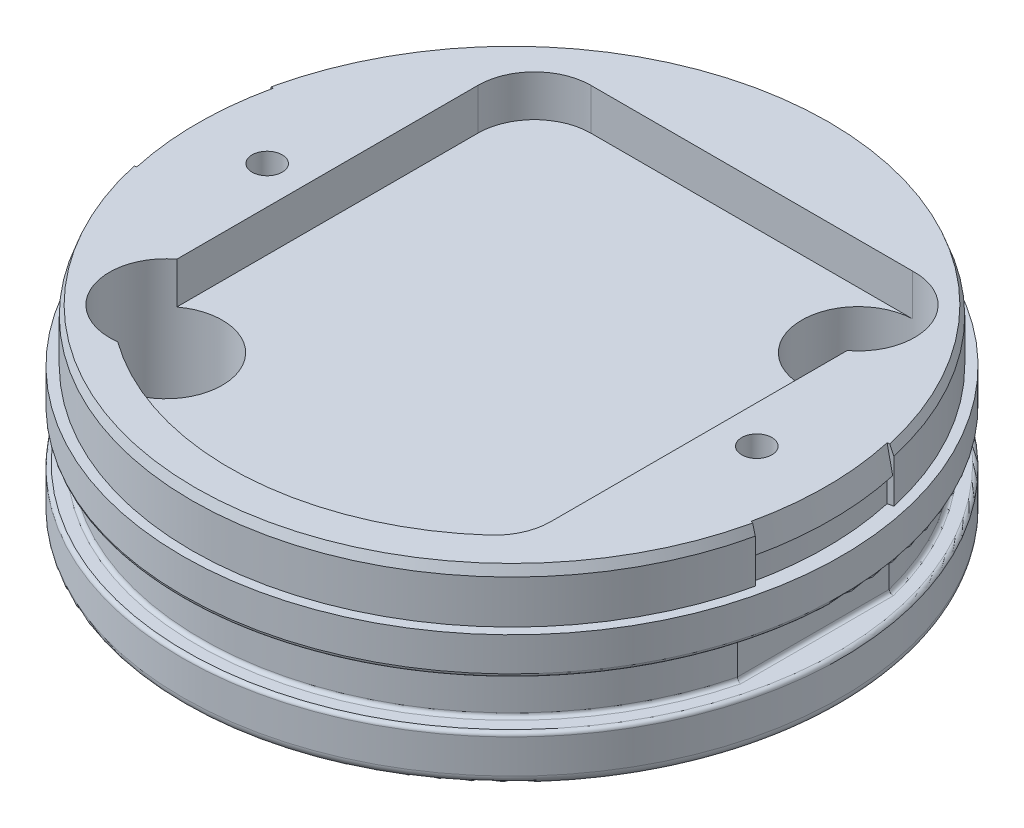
ISO-10303-21;
HEADER;
FILE_DESCRIPTION(('STEP AP214'),'2;1');
FILE_NAME('part.step','',(''),(''),'','','');
FILE_SCHEMA(('AUTOMOTIVE_DESIGN { 1 0 10303 214 1 1 1 1 }'));
ENDSEC;
DATA;
#1=APPLICATION_CONTEXT('core data for automotive mechanical design processes');
#2=APPLICATION_PROTOCOL_DEFINITION('international standard','automotive_design',2000,#1);
#3=PRODUCT_CONTEXT('',#1,'mechanical');
#4=PRODUCT('Part','Part','',(#3));
#5=PRODUCT_RELATED_PRODUCT_CATEGORY('part','',(#4));
#6=PRODUCT_DEFINITION_FORMATION('','',#4);
#7=PRODUCT_DEFINITION_CONTEXT('part definition',#1,'design');
#8=PRODUCT_DEFINITION('design','',#6,#7);
#9=PRODUCT_DEFINITION_SHAPE('','',#8);
#10=(LENGTH_UNIT() NAMED_UNIT(*) SI_UNIT(.MILLI.,.METRE.));
#11=(NAMED_UNIT(*) PLANE_ANGLE_UNIT() SI_UNIT($,.RADIAN.));
#12=(NAMED_UNIT(*) SI_UNIT($,.STERADIAN.) SOLID_ANGLE_UNIT());
#13=UNCERTAINTY_MEASURE_WITH_UNIT(LENGTH_MEASURE(1.E-05),#10,'distance_accuracy_value','');
#14=(GEOMETRIC_REPRESENTATION_CONTEXT(3) GLOBAL_UNCERTAINTY_ASSIGNED_CONTEXT((#13)) GLOBAL_UNIT_ASSIGNED_CONTEXT((#10,
#11,#12)) REPRESENTATION_CONTEXT('',''));
#15=CARTESIAN_POINT('',(0.,0.,0.));
#16=DIRECTION('',(0.,0.,1.));
#17=DIRECTION('',(1.,0.,0.));
#18=AXIS2_PLACEMENT_3D('',#15,#16,#17);
#19=CARTESIAN_POINT('',(0.,2.70000000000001,0.));
#20=DIRECTION('',(0.,-1.,0.));
#21=DIRECTION('',(0.,0.,-1.));
#22=AXIS2_PLACEMENT_3D('',#19,#20,#21);
#23=TOROIDAL_SURFACE('',#22,16.7,0.2);
#24=CARTESIAN_POINT('',(0.,2.70000000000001,0.));
#25=DIRECTION('',(0.,-1.,0.));
#26=DIRECTION('',(0.,0.,-1.));
#27=AXIS2_PLACEMENT_3D('',#24,#25,#26);
#28=CIRCLE('',#27,16.5);
#29=CARTESIAN_POINT('',(-16.,2.70000000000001,-4.03112887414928));
#30=VERTEX_POINT('',#29);
#31=CARTESIAN_POINT('',(16.,2.70000000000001,-4.03112887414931));
#32=VERTEX_POINT('',#31);
#33=EDGE_CURVE('E586',#30,#32,#28,.T.);
#34=ORIENTED_EDGE('',*,*,#33,.T.);
#35=CARTESIAN_POINT('',(16.,2.70000000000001,-4.03112887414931));
#36=CARTESIAN_POINT('',(15.9999901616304,2.68881056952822,-4.03112763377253));
#37=CARTESIAN_POINT('',(16.0009384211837,2.67762450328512,-4.03124527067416));
#38=CARTESIAN_POINT('',(16.0046780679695,2.65557992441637,-4.03170908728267));
#39=CARTESIAN_POINT('',(16.0074677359,2.64472111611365,-4.03205505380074));
#40=CARTESIAN_POINT('',(16.014818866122,2.62362559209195,-4.03296653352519));
#41=CARTESIAN_POINT('',(16.0193810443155,2.61338912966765,-4.03353213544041));
#42=CARTESIAN_POINT('',(16.0301390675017,2.59383159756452,-4.03486548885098));
#43=CARTESIAN_POINT('',(16.0363346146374,2.58451036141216,-4.03563320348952));
#44=CARTESIAN_POINT('',(16.0502039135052,2.56701044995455,-4.03735119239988));
#45=CARTESIAN_POINT('',(16.0578824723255,2.55883564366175,-4.03830206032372));
#46=CARTESIAN_POINT('',(16.0744871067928,2.543886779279,-4.04035742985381));
#47=CARTESIAN_POINT('',(16.0834136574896,2.53711325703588,-4.04146198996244));
#48=CARTESIAN_POINT('',(16.1023286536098,2.52510922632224,-4.04380143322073));
#49=CARTESIAN_POINT('',(16.1123245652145,2.51989067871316,-4.04503723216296));
#50=CARTESIAN_POINT('',(16.1330353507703,2.51121035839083,-4.04759644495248));
#51=CARTESIAN_POINT('',(16.1437495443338,2.50774694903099,-4.04891977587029));
#52=CARTESIAN_POINT('',(16.1611719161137,2.503691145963,-4.05107054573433));
#53=CARTESIAN_POINT('',(16.167750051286,2.5025041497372,-4.05188236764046));
#54=CARTESIAN_POINT('',(16.1809846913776,2.50079461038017,-4.05351518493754));
#55=CARTESIAN_POINT('',(16.1876410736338,2.50027113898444,-4.05433616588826));
#56=CARTESIAN_POINT('',(16.1962023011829,2.50002699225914,-4.05539176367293));
#57=CARTESIAN_POINT('',(16.1981013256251,2.49999992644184,-4.05562589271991));
#58=CARTESIAN_POINT('',(16.2,2.50000000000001,-4.05585995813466));
#59=B_SPLINE_CURVE_WITH_KNOTS('',3,(#35,#36,#37,#38,#39,#40,#41,#42,#43,#44,#45,#46,#47,#48,#49,
#50,#51,#52,#53,#54,#55,#56,#57,#58),.UNSPECIFIED.,.F.,.F.,(4,2,2,2,2,2,2,2,2,2,2,4),(0.,
0.0335226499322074,0.0670140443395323,0.100518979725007,0.134017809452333,0.167627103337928,
0.201249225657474,0.235123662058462,0.268966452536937,0.289138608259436,0.309282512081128,
0.315022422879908),.UNSPECIFIED.);
#60=CARTESIAN_POINT('',(16.2,2.50000000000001,-4.05585995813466));
#61=VERTEX_POINT('',#60);
#62=EDGE_CURVE('E336',#32,#61,#59,.T.);
#63=ORIENTED_EDGE('',*,*,#62,.T.);
#64=CARTESIAN_POINT('',(0.,2.50000000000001,0.));
#65=DIRECTION('',(0.,-1.,0.));
#66=DIRECTION('',(0.,0.,-1.));
#67=AXIS2_PLACEMENT_3D('',#64,#65,#66);
#68=CIRCLE('',#67,16.7);
#69=CARTESIAN_POINT('',(-16.2,2.50000000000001,-4.05585995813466));
#70=VERTEX_POINT('',#69);
#71=EDGE_CURVE('E583',#70,#61,#68,.T.);
#72=ORIENTED_EDGE('',*,*,#71,.F.);
#73=CARTESIAN_POINT('',(-16.,2.70000000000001,-4.03112887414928));
#74=CARTESIAN_POINT('',(-15.9999901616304,2.68881056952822,-4.03112763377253));
#75=CARTESIAN_POINT('',(-16.0009384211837,2.67762450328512,-4.03124527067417));
#76=CARTESIAN_POINT('',(-16.0046780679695,2.65557992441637,-4.03170908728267));
#77=CARTESIAN_POINT('',(-16.0074677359,2.64472111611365,-4.03205505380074));
#78=CARTESIAN_POINT('',(-16.014818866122,2.62362559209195,-4.0329665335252));
#79=CARTESIAN_POINT('',(-16.0193810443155,2.61338912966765,-4.03353213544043));
#80=CARTESIAN_POINT('',(-16.0301390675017,2.59383159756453,-4.034865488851));
#81=CARTESIAN_POINT('',(-16.0363346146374,2.58451036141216,-4.03563320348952));
#82=CARTESIAN_POINT('',(-16.0502039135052,2.56701044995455,-4.03735119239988));
#83=CARTESIAN_POINT('',(-16.0578824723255,2.55883564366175,-4.03830206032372));
#84=CARTESIAN_POINT('',(-16.0744871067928,2.54388677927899,-4.04035742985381));
#85=CARTESIAN_POINT('',(-16.0834136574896,2.53711325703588,-4.04146198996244));
#86=CARTESIAN_POINT('',(-16.1023286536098,2.52510922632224,-4.04380143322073));
#87=CARTESIAN_POINT('',(-16.1123245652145,2.51989067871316,-4.04503723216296));
#88=CARTESIAN_POINT('',(-16.1330353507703,2.51121035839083,-4.04759644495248));
#89=CARTESIAN_POINT('',(-16.1437495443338,2.50774694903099,-4.04891977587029));
#90=CARTESIAN_POINT('',(-16.1611719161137,2.503691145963,-4.05107054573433));
#91=CARTESIAN_POINT('',(-16.167750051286,2.5025041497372,-4.05188236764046));
#92=CARTESIAN_POINT('',(-16.1809846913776,2.50079461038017,-4.05351518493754));
#93=CARTESIAN_POINT('',(-16.1876410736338,2.50027113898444,-4.05433616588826));
#94=CARTESIAN_POINT('',(-16.1962023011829,2.50002699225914,-4.05539176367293));
#95=CARTESIAN_POINT('',(-16.1981013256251,2.49999992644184,-4.05562589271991));
#96=CARTESIAN_POINT('',(-16.2,2.50000000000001,-4.05585995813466));
#97=B_SPLINE_CURVE_WITH_KNOTS('',3,(#73,#74,#75,#76,#77,#78,#79,#80,#81,#82,#83,#84,#85,#86,#87,
#88,#89,#90,#91,#92,#93,#94,#95,#96),.UNSPECIFIED.,.F.,.F.,(4,2,2,2,2,2,2,2,2,2,2,4),(0.,
0.0335226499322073,0.0670140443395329,0.100518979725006,0.134017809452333,0.167627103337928,
0.201249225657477,0.235123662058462,0.268966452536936,0.289138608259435,0.309282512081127,
0.315022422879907),.UNSPECIFIED.);
#98=EDGE_CURVE('E286',#70,#30,#97,.F.);
#99=ORIENTED_EDGE('',*,*,#98,.T.);
#100=EDGE_LOOP('',(#34,#63,#72,#99));
#101=FACE_BOUND('',#100,.T.);
#102=ADVANCED_FACE('F39',(#101),#23,.F.);
#103=CARTESIAN_POINT('',(16.2,2.50000000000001,4.05585995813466));
#104=VERTEX_POINT('',#103);
#105=CARTESIAN_POINT('',(-16.2,2.50000000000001,4.05585995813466));
#106=VERTEX_POINT('',#105);
#107=EDGE_CURVE('E585',#104,#106,#68,.T.);
#108=ORIENTED_EDGE('',*,*,#107,.F.);
#109=CARTESIAN_POINT('',(16.,2.70000000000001,4.03112887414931));
#110=CARTESIAN_POINT('',(15.9999901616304,2.68881056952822,4.03112763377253));
#111=CARTESIAN_POINT('',(16.0009384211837,2.67762450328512,4.03124527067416));
#112=CARTESIAN_POINT('',(16.0046780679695,2.65557992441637,4.03170908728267));
#113=CARTESIAN_POINT('',(16.0074677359,2.64472111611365,4.03205505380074));
#114=CARTESIAN_POINT('',(16.014818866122,2.62362559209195,4.03296653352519));
#115=CARTESIAN_POINT('',(16.0193810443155,2.61338912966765,4.03353213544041));
#116=CARTESIAN_POINT('',(16.0301390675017,2.59383159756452,4.03486548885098));
#117=CARTESIAN_POINT('',(16.0363346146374,2.58451036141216,4.03563320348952));
#118=CARTESIAN_POINT('',(16.0502039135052,2.56701044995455,4.03735119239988));
#119=CARTESIAN_POINT('',(16.0578824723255,2.55883564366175,4.03830206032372));
#120=CARTESIAN_POINT('',(16.0744871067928,2.543886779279,4.04035742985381));
#121=CARTESIAN_POINT('',(16.0834136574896,2.53711325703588,4.04146198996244));
#122=CARTESIAN_POINT('',(16.1023286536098,2.52510922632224,4.04380143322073));
#123=CARTESIAN_POINT('',(16.1123245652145,2.51989067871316,4.04503723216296));
#124=CARTESIAN_POINT('',(16.1330353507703,2.51121035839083,4.04759644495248));
#125=CARTESIAN_POINT('',(16.1437495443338,2.50774694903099,4.04891977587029));
#126=CARTESIAN_POINT('',(16.1611719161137,2.503691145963,4.05107054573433));
#127=CARTESIAN_POINT('',(16.167750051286,2.5025041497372,4.05188236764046));
#128=CARTESIAN_POINT('',(16.1809846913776,2.50079461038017,4.05351518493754));
#129=CARTESIAN_POINT('',(16.1876410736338,2.50027113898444,4.05433616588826));
#130=CARTESIAN_POINT('',(16.1962023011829,2.50002699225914,4.05539176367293));
#131=CARTESIAN_POINT('',(16.1981013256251,2.49999992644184,4.05562589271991));
#132=CARTESIAN_POINT('',(16.2,2.50000000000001,4.05585995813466));
#133=B_SPLINE_CURVE_WITH_KNOTS('',3,(#109,#110,#111,#112,#113,#114,#115,#116,#117,#118,#119,
#120,#121,#122,#123,#124,#125,#126,#127,#128,#129,#130,#131,#132),.UNSPECIFIED.,.F.,.F.,(4,2,2,
2,2,2,2,2,2,2,2,4),(0.,0.0335226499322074,0.0670140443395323,0.100518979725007,
0.134017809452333,0.167627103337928,0.201249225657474,0.235123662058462,0.268966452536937,
0.289138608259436,0.309282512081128,0.315022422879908),.UNSPECIFIED.);
#134=CARTESIAN_POINT('',(16.,2.70000000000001,4.03112887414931));
#135=VERTEX_POINT('',#134);
#136=EDGE_CURVE('E288',#104,#135,#133,.F.);
#137=ORIENTED_EDGE('',*,*,#136,.T.);
#138=CARTESIAN_POINT('',(-16.,2.70000000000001,4.03112887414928));
#139=VERTEX_POINT('',#138);
#140=EDGE_CURVE('E270',#135,#139,#28,.T.);
#141=ORIENTED_EDGE('',*,*,#140,.T.);
#142=CARTESIAN_POINT('',(-16.,2.70000000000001,4.03112887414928));
#143=CARTESIAN_POINT('',(-15.9999901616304,2.68881056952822,4.03112763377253));
#144=CARTESIAN_POINT('',(-16.0009384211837,2.67762450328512,4.03124527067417));
#145=CARTESIAN_POINT('',(-16.0046780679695,2.65557992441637,4.03170908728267));
#146=CARTESIAN_POINT('',(-16.0074677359,2.64472111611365,4.03205505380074));
#147=CARTESIAN_POINT('',(-16.014818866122,2.62362559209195,4.0329665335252));
#148=CARTESIAN_POINT('',(-16.0193810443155,2.61338912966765,4.03353213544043));
#149=CARTESIAN_POINT('',(-16.0301390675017,2.59383159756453,4.034865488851));
#150=CARTESIAN_POINT('',(-16.0363346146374,2.58451036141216,4.03563320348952));
#151=CARTESIAN_POINT('',(-16.0502039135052,2.56701044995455,4.03735119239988));
#152=CARTESIAN_POINT('',(-16.0578824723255,2.55883564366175,4.03830206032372));
#153=CARTESIAN_POINT('',(-16.0744871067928,2.54388677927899,4.04035742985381));
#154=CARTESIAN_POINT('',(-16.0834136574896,2.53711325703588,4.04146198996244));
#155=CARTESIAN_POINT('',(-16.1023286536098,2.52510922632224,4.04380143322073));
#156=CARTESIAN_POINT('',(-16.1123245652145,2.51989067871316,4.04503723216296));
#157=CARTESIAN_POINT('',(-16.1330353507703,2.51121035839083,4.04759644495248));
#158=CARTESIAN_POINT('',(-16.1437495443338,2.50774694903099,4.04891977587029));
#159=CARTESIAN_POINT('',(-16.1611719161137,2.503691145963,4.05107054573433));
#160=CARTESIAN_POINT('',(-16.167750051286,2.5025041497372,4.05188236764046));
#161=CARTESIAN_POINT('',(-16.1809846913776,2.50079461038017,4.05351518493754));
#162=CARTESIAN_POINT('',(-16.1876410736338,2.50027113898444,4.05433616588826));
#163=CARTESIAN_POINT('',(-16.1962023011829,2.50002699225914,4.05539176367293));
#164=CARTESIAN_POINT('',(-16.1981013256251,2.49999992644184,4.05562589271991));
#165=CARTESIAN_POINT('',(-16.2,2.50000000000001,4.05585995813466));
#166=B_SPLINE_CURVE_WITH_KNOTS('',3,(#142,#143,#144,#145,#146,#147,#148,#149,#150,#151,#152,
#153,#154,#155,#156,#157,#158,#159,#160,#161,#162,#163,#164,#165),.UNSPECIFIED.,.F.,.F.,(4,2,2,
2,2,2,2,2,2,2,2,4),(0.,0.0335226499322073,0.0670140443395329,0.100518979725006,
0.134017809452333,0.167627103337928,0.201249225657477,0.235123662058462,0.268966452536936,
0.289138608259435,0.309282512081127,0.315022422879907),.UNSPECIFIED.);
#167=EDGE_CURVE('E282',#139,#106,#166,.T.);
#168=ORIENTED_EDGE('',*,*,#167,.T.);
#169=EDGE_LOOP('',(#108,#137,#141,#168));
#170=FACE_BOUND('',#169,.T.);
#171=ADVANCED_FACE('F328',(#170),#23,.F.);
#172=CARTESIAN_POINT('',(0.,0.,0.));
#173=DIRECTION('',(0.,-1.,0.));
#174=DIRECTION('',(0.,0.,-1.));
#175=AXIS2_PLACEMENT_3D('',#172,#173,#174);
#176=CYLINDRICAL_SURFACE('',#175,16.5);
#177=DIRECTION('',(0.,-1.,0.));
#178=VECTOR('',#177,1.);
#179=CARTESIAN_POINT('',(16.,0.,4.03112887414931));
#180=LINE('',#179,#178);
#181=CARTESIAN_POINT('',(16.,4.80000000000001,4.03112887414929));
#182=VERTEX_POINT('',#181);
#183=EDGE_CURVE('E252',#182,#135,#180,.T.);
#184=ORIENTED_EDGE('',*,*,#183,.F.);
#185=CARTESIAN_POINT('',(0.,4.80000000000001,0.));
#186=DIRECTION('',(0.,-1.,0.));
#187=DIRECTION('',(0.,0.,-1.));
#188=AXIS2_PLACEMENT_3D('',#185,#186,#187);
#189=CIRCLE('',#188,16.5);
#190=CARTESIAN_POINT('',(-16.,4.79999999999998,4.03112887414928));
#191=VERTEX_POINT('',#190);
#192=EDGE_CURVE('E267',#182,#191,#189,.T.);
#193=ORIENTED_EDGE('',*,*,#192,.T.);
#194=DIRECTION('',(0.,-1.,0.));
#195=VECTOR('',#194,1.);
#196=CARTESIAN_POINT('',(-16.,0.,4.03112887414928));
#197=LINE('',#196,#195);
#198=EDGE_CURVE('E600',#139,#191,#197,.F.);
#199=ORIENTED_EDGE('',*,*,#198,.F.);
#200=ORIENTED_EDGE('',*,*,#140,.F.);
#201=EDGE_LOOP('',(#184,#193,#199,#200));
#202=FACE_BOUND('',#201,.T.);
#203=ADVANCED_FACE('F265',(#202),#176,.T.);
#204=DIRECTION('',(0.,-1.,0.));
#205=VECTOR('',#204,1.);
#206=CARTESIAN_POINT('',(16.,0.,-4.03112887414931));
#207=LINE('',#206,#205);
#208=CARTESIAN_POINT('',(16.,4.80000000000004,-4.03112887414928));
#209=VERTEX_POINT('',#208);
#210=EDGE_CURVE('E255',#32,#209,#207,.F.);
#211=ORIENTED_EDGE('',*,*,#210,.F.);
#212=ORIENTED_EDGE('',*,*,#33,.F.);
#213=DIRECTION('',(0.,-1.,0.));
#214=VECTOR('',#213,1.);
#215=CARTESIAN_POINT('',(-16.,0.,-4.03112887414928));
#216=LINE('',#215,#214);
#217=CARTESIAN_POINT('',(-16.,4.80000000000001,-4.03112887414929));
#218=VERTEX_POINT('',#217);
#219=EDGE_CURVE('E598',#218,#30,#216,.T.);
#220=ORIENTED_EDGE('',*,*,#219,.F.);
#221=EDGE_CURVE('E278',#218,#209,#189,.T.);
#222=ORIENTED_EDGE('',*,*,#221,.T.);
#223=EDGE_LOOP('',(#211,#212,#220,#222));
#224=FACE_BOUND('',#223,.T.);
#225=ADVANCED_FACE('F610',(#224),#176,.T.);
#226=CARTESIAN_POINT('',(0.,4.80000000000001,0.));
#227=DIRECTION('',(0.,-1.,0.));
#228=DIRECTION('',(0.,0.,-1.));
#229=AXIS2_PLACEMENT_3D('',#226,#227,#228);
#230=TOROIDAL_SURFACE('',#229,16.7,0.199999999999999);
#231=CARTESIAN_POINT('',(0.,5.00000000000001,0.));
#232=DIRECTION('',(0.,-1.,0.));
#233=DIRECTION('',(0.,0.,-1.));
#234=AXIS2_PLACEMENT_3D('',#231,#232,#233);
#235=CIRCLE('',#234,16.7);
#236=CARTESIAN_POINT('',(-16.2,5.00000000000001,-4.05585995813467));
#237=VERTEX_POINT('',#236);
#238=CARTESIAN_POINT('',(16.2,5.00000000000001,-4.05585995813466));
#239=VERTEX_POINT('',#238);
#240=EDGE_CURVE('E58',#237,#239,#235,.T.);
#241=ORIENTED_EDGE('',*,*,#240,.T.);
#242=CARTESIAN_POINT('',(16.,4.80000000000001,-4.03112887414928));
#243=CARTESIAN_POINT('',(15.9999901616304,4.8111894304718,-4.03112763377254));
#244=CARTESIAN_POINT('',(16.0009384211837,4.8223754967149,-4.03124527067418));
#245=CARTESIAN_POINT('',(16.0046780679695,4.84442007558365,-4.03170908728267));
#246=CARTESIAN_POINT('',(16.0074677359,4.85527888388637,-4.03205505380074));
#247=CARTESIAN_POINT('',(16.014818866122,4.87637440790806,-4.03296653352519));
#248=CARTESIAN_POINT('',(16.0193810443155,4.88661087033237,-4.03353213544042));
#249=CARTESIAN_POINT('',(16.0301390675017,4.90616840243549,-4.034865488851));
#250=CARTESIAN_POINT('',(16.0363346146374,4.91548963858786,-4.03563320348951));
#251=CARTESIAN_POINT('',(16.0502039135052,4.93298955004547,-4.03735119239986));
#252=CARTESIAN_POINT('',(16.0578824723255,4.94116435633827,-4.03830206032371));
#253=CARTESIAN_POINT('',(16.0744871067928,4.95611322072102,-4.0403574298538));
#254=CARTESIAN_POINT('',(16.0834136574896,4.96288674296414,-4.04146198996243));
#255=CARTESIAN_POINT('',(16.1023286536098,4.97489077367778,-4.04380143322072));
#256=CARTESIAN_POINT('',(16.1123245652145,4.98010932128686,-4.04503723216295));
#257=CARTESIAN_POINT('',(16.1330353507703,4.98878964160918,-4.04759644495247));
#258=CARTESIAN_POINT('',(16.1437495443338,4.99225305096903,-4.04891977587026));
#259=CARTESIAN_POINT('',(16.1611719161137,4.99630885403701,-4.05107054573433));
#260=CARTESIAN_POINT('',(16.167750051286,4.99749585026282,-4.05188236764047));
#261=CARTESIAN_POINT('',(16.1809846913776,4.99920538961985,-4.05351518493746));
#262=CARTESIAN_POINT('',(16.1876410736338,4.99972886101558,-4.05433616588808));
#263=CARTESIAN_POINT('',(16.1962023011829,4.99997300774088,-4.05539176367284));
#264=CARTESIAN_POINT('',(16.1981013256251,5.00000007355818,-4.05562589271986));
#265=CARTESIAN_POINT('',(16.2,5.00000000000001,-4.05585995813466));
#266=B_SPLINE_CURVE_WITH_KNOTS('',3,(#242,#243,#244,#245,#246,#247,#248,#249,#250,#251,#252,
#253,#254,#255,#256,#257,#258,#259,#260,#261,#262,#263,#264,#265),.UNSPECIFIED.,.F.,.F.,(4,2,2,
2,2,2,2,2,2,2,2,4),(0.,0.033522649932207,0.067014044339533,0.100518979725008,0.134017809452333,
0.167627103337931,0.201249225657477,0.235123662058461,0.268966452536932,0.289138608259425,
0.309282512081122,0.315022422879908),.UNSPECIFIED.);
#267=EDGE_CURVE('E283',#239,#209,#266,.F.);
#268=ORIENTED_EDGE('',*,*,#267,.T.);
#269=ORIENTED_EDGE('',*,*,#221,.F.);
#270=CARTESIAN_POINT('',(-16.,4.80000000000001,-4.03112887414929));
#271=CARTESIAN_POINT('',(-15.9999901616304,4.8111894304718,-4.03112763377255));
#272=CARTESIAN_POINT('',(-16.0009384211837,4.8223754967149,-4.03124527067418));
#273=CARTESIAN_POINT('',(-16.0046780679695,4.84442007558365,-4.03170908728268));
#274=CARTESIAN_POINT('',(-16.0074677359,4.85527888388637,-4.03205505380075));
#275=CARTESIAN_POINT('',(-16.014818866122,4.87637440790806,-4.0329665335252));
#276=CARTESIAN_POINT('',(-16.0193810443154,4.88661087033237,-4.03353213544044));
#277=CARTESIAN_POINT('',(-16.0301390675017,4.90616840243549,-4.03486548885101));
#278=CARTESIAN_POINT('',(-16.0363346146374,4.91548963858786,-4.03563320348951));
#279=CARTESIAN_POINT('',(-16.0502039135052,4.93298955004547,-4.03735119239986));
#280=CARTESIAN_POINT('',(-16.0578824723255,4.94116435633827,-4.03830206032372));
#281=CARTESIAN_POINT('',(-16.0744871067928,4.95611322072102,-4.04035742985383));
#282=CARTESIAN_POINT('',(-16.0834136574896,4.96288674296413,-4.04146198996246));
#283=CARTESIAN_POINT('',(-16.1023286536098,4.97489077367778,-4.04380143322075));
#284=CARTESIAN_POINT('',(-16.1123245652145,4.98010932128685,-4.04503723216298));
#285=CARTESIAN_POINT('',(-16.1330353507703,4.98878964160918,-4.04759644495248));
#286=CARTESIAN_POINT('',(-16.1437495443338,4.99225305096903,-4.04891977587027));
#287=CARTESIAN_POINT('',(-16.1611719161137,4.99630885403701,-4.05107054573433));
#288=CARTESIAN_POINT('',(-16.167750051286,4.99749585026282,-4.05188236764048));
#289=CARTESIAN_POINT('',(-16.1809846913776,4.99920538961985,-4.05351518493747));
#290=CARTESIAN_POINT('',(-16.1876410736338,4.99972886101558,-4.05433616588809));
#291=CARTESIAN_POINT('',(-16.1962023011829,4.99997300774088,-4.05539176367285));
#292=CARTESIAN_POINT('',(-16.1981013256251,5.00000007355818,-4.05562589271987));
#293=CARTESIAN_POINT('',(-16.2,5.00000000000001,-4.05585995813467));
#294=B_SPLINE_CURVE_WITH_KNOTS('',3,(#270,#271,#272,#273,#274,#275,#276,#277,#278,#279,#280,
#281,#282,#283,#284,#285,#286,#287,#288,#289,#290,#291,#292,#293),.UNSPECIFIED.,.F.,.F.,(4,2,2,
2,2,2,2,2,2,2,2,4),(0.,0.0335226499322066,0.0670140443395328,0.100518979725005,
0.134017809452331,0.167627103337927,0.201249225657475,0.235123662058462,0.268966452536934,
0.289138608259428,0.309282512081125,0.315022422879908),.UNSPECIFIED.);
#295=EDGE_CURVE('E12',#218,#237,#294,.T.);
#296=ORIENTED_EDGE('',*,*,#295,.T.);
#297=EDGE_LOOP('',(#241,#268,#269,#296));
#298=FACE_BOUND('',#297,.T.);
#299=ADVANCED_FACE('F303',(#298),#230,.F.);
#300=ORIENTED_EDGE('',*,*,#192,.F.);
#301=CARTESIAN_POINT('',(16.,4.80000000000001,4.03112887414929));
#302=CARTESIAN_POINT('',(15.9999901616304,4.8111894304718,4.03112763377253));
#303=CARTESIAN_POINT('',(16.0009384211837,4.8223754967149,4.03124527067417));
#304=CARTESIAN_POINT('',(16.0046780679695,4.84442007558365,4.03170908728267));
#305=CARTESIAN_POINT('',(16.0074677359,4.85527888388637,4.03205505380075));
#306=CARTESIAN_POINT('',(16.014818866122,4.87637440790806,4.0329665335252));
#307=CARTESIAN_POINT('',(16.0193810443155,4.88661087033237,4.03353213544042));
#308=CARTESIAN_POINT('',(16.0301390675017,4.90616840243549,4.03486548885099));
#309=CARTESIAN_POINT('',(16.0363346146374,4.91548963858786,4.03563320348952));
#310=CARTESIAN_POINT('',(16.0502039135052,4.93298955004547,4.03735119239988));
#311=CARTESIAN_POINT('',(16.0578824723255,4.94116435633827,4.03830206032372));
#312=CARTESIAN_POINT('',(16.0744871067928,4.95611322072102,4.04035742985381));
#313=CARTESIAN_POINT('',(16.0834136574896,4.96288674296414,4.04146198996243));
#314=CARTESIAN_POINT('',(16.1023286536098,4.97489077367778,4.04380143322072));
#315=CARTESIAN_POINT('',(16.1123245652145,4.98010932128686,4.04503723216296));
#316=CARTESIAN_POINT('',(16.1330353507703,4.98878964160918,4.04759644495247));
#317=CARTESIAN_POINT('',(16.1437495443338,4.99225305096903,4.04891977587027));
#318=CARTESIAN_POINT('',(16.1611719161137,4.99630885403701,4.05107054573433));
#319=CARTESIAN_POINT('',(16.167750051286,4.99749585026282,4.05188236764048));
#320=CARTESIAN_POINT('',(16.1809846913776,4.99920538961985,4.05351518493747));
#321=CARTESIAN_POINT('',(16.1876410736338,4.99972886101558,4.05433616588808));
#322=CARTESIAN_POINT('',(16.1962023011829,4.99997300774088,4.05539176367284));
#323=CARTESIAN_POINT('',(16.1981013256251,5.00000007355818,4.05562589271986));
#324=CARTESIAN_POINT('',(16.2,5.00000000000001,4.05585995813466));
#325=B_SPLINE_CURVE_WITH_KNOTS('',3,(#301,#302,#303,#304,#305,#306,#307,#308,#309,#310,#311,
#312,#313,#314,#315,#316,#317,#318,#319,#320,#321,#322,#323,#324),.UNSPECIFIED.,.F.,.F.,(4,2,2,
2,2,2,2,2,2,2,2,4),(0.,0.0335226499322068,0.0670140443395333,0.100518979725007,
0.134017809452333,0.167627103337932,0.201249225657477,0.235123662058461,0.268966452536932,
0.289138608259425,0.309282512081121,0.315022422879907),.UNSPECIFIED.);
#326=CARTESIAN_POINT('',(16.2,5.00000000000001,4.05585995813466));
#327=VERTEX_POINT('',#326);
#328=EDGE_CURVE('E275',#182,#327,#325,.T.);
#329=ORIENTED_EDGE('',*,*,#328,.T.);
#330=CARTESIAN_POINT('',(-16.2,5.00000000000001,4.05585995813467));
#331=VERTEX_POINT('',#330);
#332=EDGE_CURVE('E66',#327,#331,#235,.T.);
#333=ORIENTED_EDGE('',*,*,#332,.T.);
#334=CARTESIAN_POINT('',(-16.,4.80000000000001,4.03112887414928));
#335=CARTESIAN_POINT('',(-15.9999901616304,4.8111894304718,4.03112763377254));
#336=CARTESIAN_POINT('',(-16.0009384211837,4.8223754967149,4.03124527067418));
#337=CARTESIAN_POINT('',(-16.0046780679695,4.84442007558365,4.03170908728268));
#338=CARTESIAN_POINT('',(-16.0074677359,4.85527888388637,4.03205505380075));
#339=CARTESIAN_POINT('',(-16.014818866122,4.87637440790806,4.03296653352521));
#340=CARTESIAN_POINT('',(-16.0193810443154,4.88661087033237,4.03353213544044));
#341=CARTESIAN_POINT('',(-16.0301390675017,4.90616840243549,4.03486548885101));
#342=CARTESIAN_POINT('',(-16.0363346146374,4.91548963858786,4.03563320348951));
#343=CARTESIAN_POINT('',(-16.0502039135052,4.93298955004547,4.03735119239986));
#344=CARTESIAN_POINT('',(-16.0578824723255,4.94116435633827,4.03830206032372));
#345=CARTESIAN_POINT('',(-16.0744871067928,4.95611322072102,4.04035742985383));
#346=CARTESIAN_POINT('',(-16.0834136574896,4.96288674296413,4.04146198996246));
#347=CARTESIAN_POINT('',(-16.1023286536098,4.97489077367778,4.04380143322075));
#348=CARTESIAN_POINT('',(-16.1123245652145,4.98010932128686,4.04503723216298));
#349=CARTESIAN_POINT('',(-16.1330353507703,4.98878964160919,4.04759644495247));
#350=CARTESIAN_POINT('',(-16.1437495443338,4.99225305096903,4.04891977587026));
#351=CARTESIAN_POINT('',(-16.1611719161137,4.99630885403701,4.05107054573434));
#352=CARTESIAN_POINT('',(-16.167750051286,4.99749585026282,4.0518823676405));
#353=CARTESIAN_POINT('',(-16.1809846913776,4.99920538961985,4.05351518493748));
#354=CARTESIAN_POINT('',(-16.1876410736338,4.99972886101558,4.05433616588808));
#355=CARTESIAN_POINT('',(-16.1962023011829,4.99997300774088,4.05539176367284));
#356=CARTESIAN_POINT('',(-16.1981013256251,5.00000007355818,4.05562589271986));
#357=CARTESIAN_POINT('',(-16.2,5.00000000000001,4.05585995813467));
#358=B_SPLINE_CURVE_WITH_KNOTS('',3,(#334,#335,#336,#337,#338,#339,#340,#341,#342,#343,#344,
#345,#346,#347,#348,#349,#350,#351,#352,#353,#354,#355,#356,#357),.UNSPECIFIED.,.F.,.F.,(4,2,2,
2,2,2,2,2,2,2,2,4),(0.,0.0335226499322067,0.0670140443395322,0.100518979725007,
0.134017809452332,0.167627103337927,0.201249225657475,0.235123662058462,0.268966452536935,
0.289138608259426,0.309282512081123,0.315022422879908),.UNSPECIFIED.);
#359=EDGE_CURVE('E52',#331,#191,#358,.F.);
#360=ORIENTED_EDGE('',*,*,#359,.T.);
#361=EDGE_LOOP('',(#300,#329,#333,#360));
#362=FACE_BOUND('',#361,.T.);
#363=ADVANCED_FACE('F274',(#362),#230,.F.);
#364=CARTESIAN_POINT('',(0.,9.8,0.));
#365=DIRECTION('',(0.,-1.,0.));
#366=DIRECTION('',(0.,0.,-1.));
#367=AXIS2_PLACEMENT_3D('',#364,#365,#366);
#368=CYLINDRICAL_SURFACE('',#367,17.5);
#369=CARTESIAN_POINT('',(0.,7.,0.));
#370=DIRECTION('',(0.,1.,0.));
#371=DIRECTION('',(0.,0.,1.));
#372=AXIS2_PLACEMENT_3D('',#369,#370,#371);
#373=CIRCLE('',#372,17.5);
#374=CARTESIAN_POINT('',(0.,7.,17.5));
#375=VERTEX_POINT('',#374);
#376=EDGE_CURVE('E488',#375,#375,#373,.T.);
#377=ORIENTED_EDGE('',*,*,#376,.F.);
#378=EDGE_LOOP('',(#377));
#379=FACE_BOUND('',#378,.T.);
#380=CARTESIAN_POINT('',(0.,5.20000000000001,0.));
#381=DIRECTION('',(0.,-1.,0.));
#382=DIRECTION('',(0.,0.,-1.));
#383=AXIS2_PLACEMENT_3D('',#380,#381,#382);
#384=CIRCLE('',#383,17.5);
#385=CARTESIAN_POINT('',(0.,5.20000000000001,-17.5));
#386=VERTEX_POINT('',#385);
#387=EDGE_CURVE('E592',#386,#386,#384,.T.);
#388=ORIENTED_EDGE('',*,*,#387,.F.);
#389=EDGE_LOOP('',(#388));
#390=FACE_BOUND('',#389,.T.);
#391=ADVANCED_FACE('F641',(#379,#390),#368,.T.);
#392=CARTESIAN_POINT('',(0.,9.8,0.));
#393=DIRECTION('',(0.,1.,0.));
#394=DIRECTION('',(0.,0.,1.));
#395=AXIS2_PLACEMENT_3D('',#392,#393,#394);
#396=PLANE('',#395);
#397=DIRECTION('',(0.,0.,1.));
#398=VECTOR('',#397,1.);
#399=CARTESIAN_POINT('',(-11.,9.8,-9.19));
#400=LINE('',#399,#398);
#401=CARTESIAN_POINT('',(-11.,9.8,-9.19));
#402=VERTEX_POINT('',#401);
#403=CARTESIAN_POINT('',(-11.,9.8,6.79811594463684));
#404=VERTEX_POINT('',#403);
#405=EDGE_CURVE('E430',#402,#404,#400,.T.);
#406=ORIENTED_EDGE('',*,*,#405,.F.);
#407=CARTESIAN_POINT('',(-8.,9.8,-9.19));
#408=DIRECTION('',(0.,1.,0.));
#409=DIRECTION('',(0.,0.,1.));
#410=AXIS2_PLACEMENT_3D('',#407,#408,#409);
#411=CIRCLE('',#410,3.);
#412=CARTESIAN_POINT('',(-8.,9.8,-12.19));
#413=VERTEX_POINT('',#412);
#414=EDGE_CURVE('E445',#413,#402,#411,.T.);
#415=ORIENTED_EDGE('',*,*,#414,.F.);
#416=DIRECTION('',(-1.,0.,0.));
#417=VECTOR('',#416,1.);
#418=CARTESIAN_POINT('',(9.0727084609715,9.8,-12.19));
#419=LINE('',#418,#417);
#420=CARTESIAN_POINT('',(9.0727084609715,9.8,-12.19));
#421=VERTEX_POINT('',#420);
#422=EDGE_CURVE('E448',#421,#413,#419,.T.);
#423=ORIENTED_EDGE('',*,*,#422,.F.);
#424=CARTESIAN_POINT('',(9.1923881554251,9.8,-9.19238815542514));
#425=DIRECTION('',(0.,1.,0.));
#426=DIRECTION('',(0.,0.,1.));
#427=AXIS2_PLACEMENT_3D('',#424,#425,#426);
#428=CIRCLE('',#427,3.);
#429=CARTESIAN_POINT('',(11.,9.8,-6.79811594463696));
#430=VERTEX_POINT('',#429);
#431=EDGE_CURVE('E421',#430,#421,#428,.T.);
#432=ORIENTED_EDGE('',*,*,#431,.F.);
#433=DIRECTION('',(0.,0.,-1.));
#434=VECTOR('',#433,1.);
#435=CARTESIAN_POINT('',(11.,9.8,-6.79811594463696));
#436=LINE('',#435,#434);
#437=CARTESIAN_POINT('',(11.,9.8,8.94427190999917));
#438=VERTEX_POINT('',#437);
#439=EDGE_CURVE('E451',#438,#430,#436,.T.);
#440=ORIENTED_EDGE('',*,*,#439,.F.);
#441=CARTESIAN_POINT('',(8.00000000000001,9.8,8.94427190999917));
#442=DIRECTION('',(0.,1.,0.));
#443=DIRECTION('',(0.,0.,-1.));
#444=AXIS2_PLACEMENT_3D('',#441,#442,#443);
#445=CIRCLE('',#444,3.);
#446=CARTESIAN_POINT('',(10.,9.8,11.180339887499));
#447=VERTEX_POINT('',#446);
#448=EDGE_CURVE('E454',#447,#438,#445,.T.);
#449=ORIENTED_EDGE('',*,*,#448,.F.);
#450=CARTESIAN_POINT('',(0.,9.8,0.));
#451=DIRECTION('',(0.,1.,0.));
#452=DIRECTION('',(0.,0.,-1.));
#453=AXIS2_PLACEMENT_3D('',#450,#451,#452);
#454=CIRCLE('',#453,15.);
#455=CARTESIAN_POINT('',(-8.77765648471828,9.8,12.163582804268));
#456=VERTEX_POINT('',#455);
#457=EDGE_CURVE('E457',#456,#447,#454,.T.);
#458=ORIENTED_EDGE('',*,*,#457,.F.);
#459=CARTESIAN_POINT('',(-9.19238815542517,9.8,9.19238815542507));
#460=DIRECTION('',(0.,1.,0.));
#461=DIRECTION('',(0.,0.,1.));
#462=AXIS2_PLACEMENT_3D('',#459,#460,#461);
#463=CIRCLE('',#462,3.);
#464=EDGE_CURVE('E406',#404,#456,#463,.T.);
#465=ORIENTED_EDGE('',*,*,#464,.F.);
#466=EDGE_LOOP('',(#406,#415,#423,#432,#440,#449,#458,#465));
#467=FACE_BOUND('',#466,.T.);
#468=CARTESIAN_POINT('',(-13.,9.8,0.));
#469=DIRECTION('',(0.,1.,0.));
#470=DIRECTION('',(0.,0.,1.));
#471=AXIS2_PLACEMENT_3D('',#468,#469,#470);
#472=CIRCLE('',#471,0.800000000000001);
#473=CARTESIAN_POINT('',(-13.,9.8,0.800000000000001));
#474=VERTEX_POINT('',#473);
#475=EDGE_CURVE('E460',#474,#474,#472,.T.);
#476=ORIENTED_EDGE('',*,*,#475,.F.);
#477=EDGE_LOOP('',(#476));
#478=FACE_BOUND('',#477,.T.);
#479=CARTESIAN_POINT('',(13.,9.8,0.));
#480=DIRECTION('',(0.,1.,0.));
#481=DIRECTION('',(0.,0.,1.));
#482=AXIS2_PLACEMENT_3D('',#479,#480,#481);
#483=CIRCLE('',#482,0.800000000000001);
#484=CARTESIAN_POINT('',(13.,9.8,0.800000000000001));
#485=VERTEX_POINT('',#484);
#486=EDGE_CURVE('E463',#485,#485,#483,.T.);
#487=ORIENTED_EDGE('',*,*,#486,.F.);
#488=EDGE_LOOP('',(#487));
#489=FACE_BOUND('',#488,.T.);
#490=DIRECTION('',(0.976296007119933,0.,-0.216439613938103));
#491=VECTOR('',#490,1.);
#492=CARTESIAN_POINT('',(0.,9.8,0.));
#493=LINE('',#492,#491);
#494=CARTESIAN_POINT('',(16.3041433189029,9.8,-3.61454155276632));
#495=VERTEX_POINT('',#494);
#496=CARTESIAN_POINT('',(16.4193607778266,9.8,-3.640084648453));
#497=VERTEX_POINT('',#496);
#498=EDGE_CURVE('E500',#495,#497,#493,.T.);
#499=ORIENTED_EDGE('',*,*,#498,.T.);
#500=CARTESIAN_POINT('',(0.,9.8,0.));
#501=DIRECTION('',(0.,1.,0.));
#502=DIRECTION('',(0.,0.,1.));
#503=AXIS2_PLACEMENT_3D('',#500,#501,#502);
#504=CIRCLE('',#503,16.8180148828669);
#505=CARTESIAN_POINT('',(-16.4193607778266,9.8,-3.640084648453));
#506=VERTEX_POINT('',#505);
#507=EDGE_CURVE('E396',#497,#506,#504,.T.);
#508=ORIENTED_EDGE('',*,*,#507,.T.);
#509=DIRECTION('',(0.976296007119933,0.,0.216439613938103));
#510=VECTOR('',#509,1.);
#511=CARTESIAN_POINT('',(0.,9.8,0.));
#512=LINE('',#511,#510);
#513=CARTESIAN_POINT('',(-16.3041433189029,9.8,-3.61454155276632));
#514=VERTEX_POINT('',#513);
#515=EDGE_CURVE('E538',#506,#514,#512,.T.);
#516=ORIENTED_EDGE('',*,*,#515,.T.);
#517=CARTESIAN_POINT('',(0.,9.8,0.));
#518=DIRECTION('',(0.,1.,0.));
#519=DIRECTION('',(0.,0.,1.));
#520=AXIS2_PLACEMENT_3D('',#517,#518,#519);
#521=CIRCLE('',#520,16.7);
#522=CARTESIAN_POINT('',(-16.3041433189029,9.8,3.61454155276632));
#523=VERTEX_POINT('',#522);
#524=EDGE_CURVE('E555',#514,#523,#521,.T.);
#525=ORIENTED_EDGE('',*,*,#524,.T.);
#526=DIRECTION('',(0.976296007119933,0.,-0.216439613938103));
#527=VECTOR('',#526,1.);
#528=CARTESIAN_POINT('',(0.,9.8,0.));
#529=LINE('',#528,#527);
#530=CARTESIAN_POINT('',(-16.4193607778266,9.8,3.640084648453));
#531=VERTEX_POINT('',#530);
#532=EDGE_CURVE('E543',#531,#523,#529,.T.);
#533=ORIENTED_EDGE('',*,*,#532,.F.);
#534=CARTESIAN_POINT('',(0.,9.8,0.));
#535=DIRECTION('',(0.,1.,0.));
#536=DIRECTION('',(0.,0.,1.));
#537=AXIS2_PLACEMENT_3D('',#534,#535,#536);
#538=CIRCLE('',#537,16.8180148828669);
#539=CARTESIAN_POINT('',(16.4193607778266,9.8,3.640084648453));
#540=VERTEX_POINT('',#539);
#541=EDGE_CURVE('E399',#531,#540,#538,.T.);
#542=ORIENTED_EDGE('',*,*,#541,.T.);
#543=DIRECTION('',(0.976296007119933,0.,0.216439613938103));
#544=VECTOR('',#543,1.);
#545=CARTESIAN_POINT('',(0.,9.8,0.));
#546=LINE('',#545,#544);
#547=CARTESIAN_POINT('',(16.3041433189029,9.8,3.61454155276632));
#548=VERTEX_POINT('',#547);
#549=EDGE_CURVE('E495',#548,#540,#546,.T.);
#550=ORIENTED_EDGE('',*,*,#549,.F.);
#551=CARTESIAN_POINT('',(0.,9.8,0.));
#552=DIRECTION('',(0.,1.,0.));
#553=DIRECTION('',(0.,0.,1.));
#554=AXIS2_PLACEMENT_3D('',#551,#552,#553);
#555=CIRCLE('',#554,16.7);
#556=EDGE_CURVE('E507',#548,#495,#555,.T.);
#557=ORIENTED_EDGE('',*,*,#556,.T.);
#558=EDGE_LOOP('',(#499,#508,#516,#525,#533,#542,#550,#557));
#559=FACE_BOUND('',#558,.T.);
#560=ADVANCED_FACE('F643',(#467,#478,#489,#559),#396,.T.);
#561=CARTESIAN_POINT('',(0.,7.3,0.));
#562=DIRECTION('',(0.,1.,0.));
#563=DIRECTION('',(0.,0.,1.));
#564=AXIS2_PLACEMENT_3D('',#561,#562,#563);
#565=CYLINDRICAL_SURFACE('',#564,17.);
#566=DIRECTION('',(0.,1.,0.));
#567=VECTOR('',#566,1.);
#568=CARTESIAN_POINT('',(-16.5970321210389,7.3,-3.67947343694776));
#569=LINE('',#568,#567);
#570=CARTESIAN_POINT('',(-16.5970321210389,7.,-3.67947343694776));
#571=VERTEX_POINT('',#570);
#572=CARTESIAN_POINT('',(-16.5970321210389,9.30000000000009,-3.67947343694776));
#573=VERTEX_POINT('',#572);
#574=EDGE_CURVE('E540',#571,#573,#569,.T.);
#575=ORIENTED_EDGE('',*,*,#574,.T.);
#576=CARTESIAN_POINT('',(0.,9.30000000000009,0.));
#577=DIRECTION('',(0.,1.,0.));
#578=DIRECTION('',(0.,0.,1.));
#579=AXIS2_PLACEMENT_3D('',#576,#577,#578);
#580=CIRCLE('',#579,17.);
#581=CARTESIAN_POINT('',(16.5970321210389,9.30000000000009,-3.67947343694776));
#582=VERTEX_POINT('',#581);
#583=EDGE_CURVE('E392',#573,#582,#580,.F.);
#584=ORIENTED_EDGE('',*,*,#583,.T.);
#585=DIRECTION('',(0.,1.,0.));
#586=VECTOR('',#585,1.);
#587=CARTESIAN_POINT('',(16.5970321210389,7.3,-3.67947343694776));
#588=LINE('',#587,#586);
#589=CARTESIAN_POINT('',(16.5970321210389,7.,-3.67947343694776));
#590=VERTEX_POINT('',#589);
#591=EDGE_CURVE('E503',#582,#590,#588,.F.);
#592=ORIENTED_EDGE('',*,*,#591,.T.);
#593=CARTESIAN_POINT('',(0.,7.,0.));
#594=DIRECTION('',(0.,1.,0.));
#595=DIRECTION('',(0.,0.,1.));
#596=AXIS2_PLACEMENT_3D('',#593,#594,#595);
#597=CIRCLE('',#596,17.);
#598=EDGE_CURVE('E491',#590,#571,#597,.T.);
#599=ORIENTED_EDGE('',*,*,#598,.T.);
#600=EDGE_LOOP('',(#575,#584,#592,#599));
#601=FACE_BOUND('',#600,.T.);
#602=ADVANCED_FACE('F651',(#601),#565,.T.);
#603=CARTESIAN_POINT('',(0.,2.30000000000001,0.));
#604=DIRECTION('',(0.,-1.,0.));
#605=DIRECTION('',(0.,0.,-1.));
#606=AXIS2_PLACEMENT_3D('',#603,#604,#605);
#607=CIRCLE('',#606,17.5);
#608=CARTESIAN_POINT('',(0.,2.30000000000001,-17.5));
#609=VERTEX_POINT('',#608);
#610=EDGE_CURVE('E595',#609,#609,#607,.T.);
#611=ORIENTED_EDGE('',*,*,#610,.T.);
#612=EDGE_LOOP('',(#611));
#613=FACE_BOUND('',#612,.T.);
#614=CARTESIAN_POINT('',(0.,0.5,0.));
#615=DIRECTION('',(0.,1.,0.));
#616=DIRECTION('',(0.,0.,1.));
#617=AXIS2_PLACEMENT_3D('',#614,#615,#616);
#618=CIRCLE('',#617,17.5);
#619=CARTESIAN_POINT('',(0.,0.5,17.5));
#620=VERTEX_POINT('',#619);
#621=EDGE_CURVE('E369',#620,#620,#618,.T.);
#622=ORIENTED_EDGE('',*,*,#621,.T.);
#623=EDGE_LOOP('',(#622));
#624=FACE_BOUND('',#623,.T.);
#625=ADVANCED_FACE('F646',(#613,#624),#368,.T.);
#626=CARTESIAN_POINT('',(0.,9.8,0.));
#627=DIRECTION('',(0.,-1.,0.));
#628=DIRECTION('',(0.,0.,-1.));
#629=AXIS2_PLACEMENT_3D('',#626,#627,#628);
#630=CYLINDRICAL_SURFACE('',#629,4.61);
#631=CARTESIAN_POINT('',(0.,0.3,0.));
#632=DIRECTION('',(0.,1.,0.));
#633=DIRECTION('',(0.,0.,1.));
#634=AXIS2_PLACEMENT_3D('',#631,#632,#633);
#635=CIRCLE('',#634,4.61);
#636=CARTESIAN_POINT('',(0.,0.3,4.61));
#637=VERTEX_POINT('',#636);
#638=EDGE_CURVE('E372',#637,#637,#635,.F.);
#639=ORIENTED_EDGE('',*,*,#638,.T.);
#640=EDGE_LOOP('',(#639));
#641=FACE_BOUND('',#640,.T.);
#642=CARTESIAN_POINT('',(0.,5.8,0.));
#643=DIRECTION('',(0.,1.,0.));
#644=DIRECTION('',(0.,0.,1.));
#645=AXIS2_PLACEMENT_3D('',#642,#643,#644);
#646=CIRCLE('',#645,4.61);
#647=CARTESIAN_POINT('',(0.,5.8,4.61));
#648=VERTEX_POINT('',#647);
#649=EDGE_CURVE('E381',#648,#648,#646,.T.);
#650=ORIENTED_EDGE('',*,*,#649,.T.);
#651=EDGE_LOOP('',(#650));
#652=FACE_BOUND('',#651,.T.);
#653=ADVANCED_FACE('F658',(#641,#652),#630,.F.);
#654=CARTESIAN_POINT('',(9.1923881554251,9.8,-9.19238815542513));
#655=DIRECTION('',(0.,-1.,0.));
#656=DIRECTION('',(0.,0.,-1.));
#657=AXIS2_PLACEMENT_3D('',#654,#655,#656);
#658=CYLINDRICAL_SURFACE('',#657,1.25);
#659=CARTESIAN_POINT('',(9.1923881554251,0.,-9.19238815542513));
#660=DIRECTION('',(0.,1.,0.));
#661=DIRECTION('',(0.,0.,1.));
#662=AXIS2_PLACEMENT_3D('',#659,#660,#661);
#663=CIRCLE('',#662,1.25);
#664=CARTESIAN_POINT('',(9.1923881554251,0.,-7.94238815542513));
#665=VERTEX_POINT('',#664);
#666=EDGE_CURVE('E411',#665,#665,#663,.T.);
#667=ORIENTED_EDGE('',*,*,#666,.F.);
#668=EDGE_LOOP('',(#667));
#669=FACE_BOUND('',#668,.T.);
#670=CARTESIAN_POINT('',(9.1923881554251,2.49999999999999,-9.19238815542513));
#671=DIRECTION('',(0.,1.,0.));
#672=DIRECTION('',(0.,0.,1.));
#673=AXIS2_PLACEMENT_3D('',#670,#671,#672);
#674=CIRCLE('',#673,1.25);
#675=CARTESIAN_POINT('',(9.1923881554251,2.49999999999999,-7.94238815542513));
#676=VERTEX_POINT('',#675);
#677=EDGE_CURVE('E403',#676,#676,#674,.T.);
#678=ORIENTED_EDGE('',*,*,#677,.T.);
#679=EDGE_LOOP('',(#678));
#680=FACE_BOUND('',#679,.T.);
#681=ADVANCED_FACE('F664',(#669,#680),#658,.F.);
#682=CARTESIAN_POINT('',(-9.19238815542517,9.8,9.19238815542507));
#683=DIRECTION('',(0.,-1.,0.));
#684=DIRECTION('',(0.,0.,-1.));
#685=AXIS2_PLACEMENT_3D('',#682,#683,#684);
#686=CYLINDRICAL_SURFACE('',#685,1.25);
#687=CARTESIAN_POINT('',(-9.19238815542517,0.,9.19238815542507));
#688=DIRECTION('',(0.,1.,0.));
#689=DIRECTION('',(0.,0.,1.));
#690=AXIS2_PLACEMENT_3D('',#687,#688,#689);
#691=CIRCLE('',#690,1.25);
#692=CARTESIAN_POINT('',(-9.19238815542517,0.,10.4423881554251));
#693=VERTEX_POINT('',#692);
#694=EDGE_CURVE('E402',#693,#693,#691,.T.);
#695=ORIENTED_EDGE('',*,*,#694,.F.);
#696=EDGE_LOOP('',(#695));
#697=FACE_BOUND('',#696,.T.);
#698=CARTESIAN_POINT('',(-9.19238815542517,2.49999999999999,9.19238815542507));
#699=DIRECTION('',(0.,1.,0.));
#700=DIRECTION('',(0.,0.,1.));
#701=AXIS2_PLACEMENT_3D('',#698,#699,#700);
#702=CIRCLE('',#701,1.25);
#703=CARTESIAN_POINT('',(-9.19238815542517,2.49999999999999,10.4423881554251));
#704=VERTEX_POINT('',#703);
#705=EDGE_CURVE('E408',#704,#704,#702,.T.);
#706=ORIENTED_EDGE('',*,*,#705,.T.);
#707=EDGE_LOOP('',(#706));
#708=FACE_BOUND('',#707,.T.);
#709=ADVANCED_FACE('F848',(#697,#708),#686,.F.);
#710=CARTESIAN_POINT('',(0.,0.,0.));
#711=DIRECTION('',(0.,1.,0.));
#712=DIRECTION('',(0.,0.,1.));
#713=AXIS2_PLACEMENT_3D('',#710,#711,#712);
#714=PLANE('',#713);
#715=CARTESIAN_POINT('',(0.,0.,0.));
#716=DIRECTION('',(0.,1.,0.));
#717=DIRECTION('',(0.,0.,1.));
#718=AXIS2_PLACEMENT_3D('',#715,#716,#717);
#719=CIRCLE('',#718,17.);
#720=CARTESIAN_POINT('',(0.,0.,17.));
#721=VERTEX_POINT('',#720);
#722=EDGE_CURVE('E260',#721,#721,#719,.F.);
#723=ORIENTED_EDGE('',*,*,#722,.T.);
#724=EDGE_LOOP('',(#723));
#725=FACE_BOUND('',#724,.T.);
#726=CARTESIAN_POINT('',(0.,0.,0.));
#727=DIRECTION('',(0.,1.,0.));
#728=DIRECTION('',(0.,0.,1.));
#729=AXIS2_PLACEMENT_3D('',#726,#727,#728);
#730=CIRCLE('',#729,4.91);
#731=CARTESIAN_POINT('',(0.,0.,4.91));
#732=VERTEX_POINT('',#731);
#733=EDGE_CURVE('E375',#732,#732,#730,.T.);
#734=ORIENTED_EDGE('',*,*,#733,.T.);
#735=EDGE_LOOP('',(#734));
#736=FACE_BOUND('',#735,.T.);
#737=ORIENTED_EDGE('',*,*,#694,.T.);
#738=EDGE_LOOP('',(#737));
#739=FACE_BOUND('',#738,.T.);
#740=ORIENTED_EDGE('',*,*,#666,.T.);
#741=EDGE_LOOP('',(#740));
#742=FACE_BOUND('',#741,.T.);
#743=ADVANCED_FACE('F844',(#725,#736,#739,#742),#714,.F.);
#744=CARTESIAN_POINT('',(-9.19238815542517,2.49999999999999,9.19238815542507));
#745=DIRECTION('',(0.,1.,0.));
#746=DIRECTION('',(0.,0.,1.));
#747=AXIS2_PLACEMENT_3D('',#744,#745,#746);
#748=CYLINDRICAL_SURFACE('',#747,3.);
#749=CARTESIAN_POINT('',(-9.19238815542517,7.6,9.19238815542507));
#750=DIRECTION('',(0.,-1.,0.));
#751=DIRECTION('',(0.,0.,1.));
#752=AXIS2_PLACEMENT_3D('',#749,#750,#751);
#753=CIRCLE('',#752,3.);
#754=CARTESIAN_POINT('',(-11.,7.6,6.79811594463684));
#755=VERTEX_POINT('',#754);
#756=CARTESIAN_POINT('',(-8.77765648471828,7.6,12.163582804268));
#757=VERTEX_POINT('',#756);
#758=EDGE_CURVE('E472',#755,#757,#753,.T.);
#759=ORIENTED_EDGE('',*,*,#758,.F.);
#760=DIRECTION('',(0.,1.,0.));
#761=VECTOR('',#760,1.);
#762=CARTESIAN_POINT('',(-11.,7.3,6.79811594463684));
#763=LINE('',#762,#761);
#764=EDGE_CURVE('E424',#755,#404,#763,.T.);
#765=ORIENTED_EDGE('',*,*,#764,.T.);
#766=ORIENTED_EDGE('',*,*,#464,.T.);
#767=DIRECTION('',(0.,1.,0.));
#768=VECTOR('',#767,1.);
#769=CARTESIAN_POINT('',(-8.77765648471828,7.3,12.163582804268));
#770=LINE('',#769,#768);
#771=EDGE_CURVE('E427',#757,#456,#770,.T.);
#772=ORIENTED_EDGE('',*,*,#771,.F.);
#773=EDGE_LOOP('',(#759,#765,#766,#772));
#774=FACE_BOUND('',#773,.T.);
#775=CARTESIAN_POINT('',(-9.19238815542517,2.49999999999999,9.19238815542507));
#776=DIRECTION('',(0.,1.,0.));
#777=DIRECTION('',(0.,0.,1.));
#778=AXIS2_PLACEMENT_3D('',#775,#776,#777);
#779=CIRCLE('',#778,3.);
#780=CARTESIAN_POINT('',(-9.19238815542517,2.49999999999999,12.1923881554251));
#781=VERTEX_POINT('',#780);
#782=EDGE_CURVE('E412',#781,#781,#779,.T.);
#783=ORIENTED_EDGE('',*,*,#782,.F.);
#784=EDGE_LOOP('',(#783));
#785=FACE_BOUND('',#784,.T.);
#786=ADVANCED_FACE('F840',(#774,#785),#748,.F.);
#787=CARTESIAN_POINT('',(-9.19238815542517,2.49999999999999,9.19238815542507));
#788=DIRECTION('',(0.,1.,0.));
#789=DIRECTION('',(0.,0.,1.));
#790=AXIS2_PLACEMENT_3D('',#787,#788,#789);
#791=PLANE('',#790);
#792=ORIENTED_EDGE('',*,*,#705,.F.);
#793=EDGE_LOOP('',(#792));
#794=FACE_BOUND('',#793,.T.);
#795=ORIENTED_EDGE('',*,*,#782,.T.);
#796=EDGE_LOOP('',(#795));
#797=FACE_BOUND('',#796,.T.);
#798=ADVANCED_FACE('F836',(#794,#797),#791,.T.);
#799=CARTESIAN_POINT('',(9.1923881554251,2.49999999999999,-9.19238815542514));
#800=DIRECTION('',(0.,1.,0.));
#801=DIRECTION('',(0.,0.,1.));
#802=AXIS2_PLACEMENT_3D('',#799,#800,#801);
#803=CYLINDRICAL_SURFACE('',#802,3.);
#804=DIRECTION('',(0.,1.,0.));
#805=VECTOR('',#804,1.);
#806=CARTESIAN_POINT('',(9.0727084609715,7.3,-12.19));
#807=LINE('',#806,#805);
#808=CARTESIAN_POINT('',(9.0727084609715,7.6,-12.19));
#809=VERTEX_POINT('',#808);
#810=EDGE_CURVE('E436',#809,#421,#807,.T.);
#811=ORIENTED_EDGE('',*,*,#810,.F.);
#812=CARTESIAN_POINT('',(9.1923881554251,7.6,-9.19238815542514));
#813=DIRECTION('',(0.,-1.,0.));
#814=DIRECTION('',(0.,0.,1.));
#815=AXIS2_PLACEMENT_3D('',#812,#813,#814);
#816=CIRCLE('',#815,3.);
#817=CARTESIAN_POINT('',(11.,7.6,-6.79811594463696));
#818=VERTEX_POINT('',#817);
#819=EDGE_CURVE('E480',#818,#809,#816,.T.);
#820=ORIENTED_EDGE('',*,*,#819,.F.);
#821=DIRECTION('',(0.,1.,0.));
#822=VECTOR('',#821,1.);
#823=CARTESIAN_POINT('',(11.,7.3,-6.79811594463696));
#824=LINE('',#823,#822);
#825=EDGE_CURVE('E434',#818,#430,#824,.T.);
#826=ORIENTED_EDGE('',*,*,#825,.T.);
#827=ORIENTED_EDGE('',*,*,#431,.T.);
#828=EDGE_LOOP('',(#811,#820,#826,#827));
#829=FACE_BOUND('',#828,.T.);
#830=CARTESIAN_POINT('',(9.1923881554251,2.49999999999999,-9.19238815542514));
#831=DIRECTION('',(0.,1.,0.));
#832=DIRECTION('',(0.,0.,1.));
#833=AXIS2_PLACEMENT_3D('',#830,#831,#832);
#834=CIRCLE('',#833,3.);
#835=CARTESIAN_POINT('',(9.1923881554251,2.49999999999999,-6.19238815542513));
#836=VERTEX_POINT('',#835);
#837=EDGE_CURVE('E407',#836,#836,#834,.T.);
#838=ORIENTED_EDGE('',*,*,#837,.F.);
#839=EDGE_LOOP('',(#838));
#840=FACE_BOUND('',#839,.T.);
#841=ADVANCED_FACE('F832',(#829,#840),#803,.F.);
#842=CARTESIAN_POINT('',(9.1923881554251,2.49999999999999,-9.19238815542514));
#843=DIRECTION('',(0.,1.,0.));
#844=DIRECTION('',(0.,0.,1.));
#845=AXIS2_PLACEMENT_3D('',#842,#843,#844);
#846=PLANE('',#845);
#847=ORIENTED_EDGE('',*,*,#677,.F.);
#848=EDGE_LOOP('',(#847));
#849=FACE_BOUND('',#848,.T.);
#850=ORIENTED_EDGE('',*,*,#837,.T.);
#851=EDGE_LOOP('',(#850));
#852=FACE_BOUND('',#851,.T.);
#853=ADVANCED_FACE('F810',(#849,#852),#846,.T.);
#854=CARTESIAN_POINT('',(-11.,7.3,-9.19));
#855=DIRECTION('',(-1.,0.,0.));
#856=DIRECTION('',(0.,0.,1.));
#857=AXIS2_PLACEMENT_3D('',#854,#855,#856);
#858=PLANE('',#857);
#859=ORIENTED_EDGE('',*,*,#764,.F.);
#860=DIRECTION('',(0.,0.,1.));
#861=VECTOR('',#860,1.);
#862=CARTESIAN_POINT('',(-11.,7.6,-9.19));
#863=LINE('',#862,#861);
#864=CARTESIAN_POINT('',(-11.,7.6,-9.19));
#865=VERTEX_POINT('',#864);
#866=EDGE_CURVE('E474',#865,#755,#863,.T.);
#867=ORIENTED_EDGE('',*,*,#866,.F.);
#868=DIRECTION('',(0.,1.,0.));
#869=VECTOR('',#868,1.);
#870=CARTESIAN_POINT('',(-11.,7.3,-9.19));
#871=LINE('',#870,#869);
#872=EDGE_CURVE('E440',#865,#402,#871,.T.);
#873=ORIENTED_EDGE('',*,*,#872,.T.);
#874=ORIENTED_EDGE('',*,*,#405,.T.);
#875=EDGE_LOOP('',(#859,#867,#873,#874));
#876=FACE_BOUND('',#875,.T.);
#877=ADVANCED_FACE('F806',(#876),#858,.F.);
#878=CARTESIAN_POINT('',(-8.,7.3,-9.19));
#879=DIRECTION('',(0.,1.,0.));
#880=DIRECTION('',(0.,0.,1.));
#881=AXIS2_PLACEMENT_3D('',#878,#879,#880);
#882=CYLINDRICAL_SURFACE('',#881,3.);
#883=ORIENTED_EDGE('',*,*,#872,.F.);
#884=CARTESIAN_POINT('',(-8.,7.6,-9.19));
#885=DIRECTION('',(0.,1.,0.));
#886=DIRECTION('',(0.,0.,1.));
#887=AXIS2_PLACEMENT_3D('',#884,#885,#886);
#888=CIRCLE('',#887,3.);
#889=CARTESIAN_POINT('',(-8.,7.6,-12.19));
#890=VERTEX_POINT('',#889);
#891=EDGE_CURVE('E476',#890,#865,#888,.T.);
#892=ORIENTED_EDGE('',*,*,#891,.F.);
#893=DIRECTION('',(0.,1.,0.));
#894=VECTOR('',#893,1.);
#895=CARTESIAN_POINT('',(-8.,7.3,-12.19));
#896=LINE('',#895,#894);
#897=EDGE_CURVE('E438',#890,#413,#896,.T.);
#898=ORIENTED_EDGE('',*,*,#897,.T.);
#899=ORIENTED_EDGE('',*,*,#414,.T.);
#900=EDGE_LOOP('',(#883,#892,#898,#899));
#901=FACE_BOUND('',#900,.T.);
#902=ADVANCED_FACE('F809',(#901),#882,.F.);
#903=CARTESIAN_POINT('',(9.0727084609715,7.3,-12.19));
#904=DIRECTION('',(0.,0.,-1.));
#905=DIRECTION('',(-1.,0.,0.));
#906=AXIS2_PLACEMENT_3D('',#903,#904,#905);
#907=PLANE('',#906);
#908=ORIENTED_EDGE('',*,*,#897,.F.);
#909=DIRECTION('',(-1.,0.,0.));
#910=VECTOR('',#909,1.);
#911=CARTESIAN_POINT('',(9.0727084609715,7.6,-12.19));
#912=LINE('',#911,#910);
#913=EDGE_CURVE('E478',#809,#890,#912,.T.);
#914=ORIENTED_EDGE('',*,*,#913,.F.);
#915=ORIENTED_EDGE('',*,*,#810,.T.);
#916=ORIENTED_EDGE('',*,*,#422,.T.);
#917=EDGE_LOOP('',(#908,#914,#915,#916));
#918=FACE_BOUND('',#917,.T.);
#919=ADVANCED_FACE('F814',(#918),#907,.F.);
#920=CARTESIAN_POINT('',(11.,7.3,-6.79811594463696));
#921=DIRECTION('',(1.,0.,0.));
#922=DIRECTION('',(0.,0.,-1.));
#923=AXIS2_PLACEMENT_3D('',#920,#921,#922);
#924=PLANE('',#923);
#925=ORIENTED_EDGE('',*,*,#825,.F.);
#926=DIRECTION('',(0.,0.,-1.));
#927=VECTOR('',#926,1.);
#928=CARTESIAN_POINT('',(11.,7.6,8.94427190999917));
#929=LINE('',#928,#927);
#930=CARTESIAN_POINT('',(11.,7.6,8.94427190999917));
#931=VERTEX_POINT('',#930);
#932=EDGE_CURVE('E482',#931,#818,#929,.T.);
#933=ORIENTED_EDGE('',*,*,#932,.F.);
#934=DIRECTION('',(0.,1.,0.));
#935=VECTOR('',#934,1.);
#936=CARTESIAN_POINT('',(11.,7.3,8.94427190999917));
#937=LINE('',#936,#935);
#938=EDGE_CURVE('E432',#931,#438,#937,.T.);
#939=ORIENTED_EDGE('',*,*,#938,.T.);
#940=ORIENTED_EDGE('',*,*,#439,.T.);
#941=EDGE_LOOP('',(#925,#933,#939,#940));
#942=FACE_BOUND('',#941,.T.);
#943=ADVANCED_FACE('F818',(#942),#924,.F.);
#944=CARTESIAN_POINT('',(8.00000000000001,7.3,8.94427190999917));
#945=DIRECTION('',(0.,1.,0.));
#946=DIRECTION('',(0.,0.,1.));
#947=AXIS2_PLACEMENT_3D('',#944,#945,#946);
#948=CYLINDRICAL_SURFACE('',#947,3.);
#949=ORIENTED_EDGE('',*,*,#938,.F.);
#950=CARTESIAN_POINT('',(8.00000000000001,7.6,8.94427190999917));
#951=DIRECTION('',(0.,1.,0.));
#952=DIRECTION('',(0.,0.,1.));
#953=AXIS2_PLACEMENT_3D('',#950,#951,#952);
#954=CIRCLE('',#953,3.);
#955=CARTESIAN_POINT('',(10.,7.6,11.180339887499));
#956=VERTEX_POINT('',#955);
#957=EDGE_CURVE('E484',#956,#931,#954,.T.);
#958=ORIENTED_EDGE('',*,*,#957,.F.);
#959=DIRECTION('',(0.,1.,0.));
#960=VECTOR('',#959,1.);
#961=CARTESIAN_POINT('',(10.,7.3,11.180339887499));
#962=LINE('',#961,#960);
#963=EDGE_CURVE('E429',#956,#447,#962,.T.);
#964=ORIENTED_EDGE('',*,*,#963,.T.);
#965=ORIENTED_EDGE('',*,*,#448,.T.);
#966=EDGE_LOOP('',(#949,#958,#964,#965));
#967=FACE_BOUND('',#966,.T.);
#968=ADVANCED_FACE('F822',(#967),#948,.F.);
#969=CARTESIAN_POINT('',(0.,7.3,0.));
#970=DIRECTION('',(0.,1.,0.));
#971=DIRECTION('',(0.,0.,1.));
#972=AXIS2_PLACEMENT_3D('',#969,#970,#971);
#973=CYLINDRICAL_SURFACE('',#972,15.);
#974=ORIENTED_EDGE('',*,*,#963,.F.);
#975=CARTESIAN_POINT('',(0.,7.6,0.));
#976=DIRECTION('',(0.,1.,0.));
#977=DIRECTION('',(0.,0.,1.));
#978=AXIS2_PLACEMENT_3D('',#975,#976,#977);
#979=CIRCLE('',#978,15.);
#980=EDGE_CURVE('E486',#757,#956,#979,.T.);
#981=ORIENTED_EDGE('',*,*,#980,.F.);
#982=ORIENTED_EDGE('',*,*,#771,.T.);
#983=ORIENTED_EDGE('',*,*,#457,.T.);
#984=EDGE_LOOP('',(#974,#981,#982,#983));
#985=FACE_BOUND('',#984,.T.);
#986=ADVANCED_FACE('F805',(#985),#973,.F.);
#987=DIRECTION('',(0.,1.,0.));
#988=VECTOR('',#987,1.);
#989=CARTESIAN_POINT('',(16.5970321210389,7.3,3.67947343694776));
#990=LINE('',#989,#988);
#991=CARTESIAN_POINT('',(16.5970321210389,9.30000000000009,3.67947343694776));
#992=VERTEX_POINT('',#991);
#993=CARTESIAN_POINT('',(16.5970321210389,7.,3.67947343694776));
#994=VERTEX_POINT('',#993);
#995=EDGE_CURVE('E498',#992,#994,#990,.F.);
#996=ORIENTED_EDGE('',*,*,#995,.F.);
#997=CARTESIAN_POINT('',(0.,9.30000000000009,0.));
#998=DIRECTION('',(0.,1.,0.));
#999=DIRECTION('',(0.,0.,1.));
#1000=AXIS2_PLACEMENT_3D('',#997,#998,#999);
#1001=CIRCLE('',#1000,17.);
#1002=CARTESIAN_POINT('',(-16.5970321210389,9.30000000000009,3.67947343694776));
#1003=VERTEX_POINT('',#1002);
#1004=EDGE_CURVE('E386',#992,#1003,#1001,.F.);
#1005=ORIENTED_EDGE('',*,*,#1004,.T.);
#1006=DIRECTION('',(0.,1.,0.));
#1007=VECTOR('',#1006,1.);
#1008=CARTESIAN_POINT('',(-16.5970321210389,7.3,3.67947343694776));
#1009=LINE('',#1008,#1007);
#1010=CARTESIAN_POINT('',(-16.5970321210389,7.,3.67947343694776));
#1011=VERTEX_POINT('',#1010);
#1012=EDGE_CURVE('E545',#1011,#1003,#1009,.T.);
#1013=ORIENTED_EDGE('',*,*,#1012,.F.);
#1014=EDGE_CURVE('E494',#1011,#994,#597,.T.);
#1015=ORIENTED_EDGE('',*,*,#1014,.T.);
#1016=EDGE_LOOP('',(#996,#1005,#1013,#1015));
#1017=FACE_BOUND('',#1016,.T.);
#1018=ADVANCED_FACE('F669',(#1017),#565,.T.);
#1019=CARTESIAN_POINT('',(-13.,3.8,0.));
#1020=DIRECTION('',(0.,1.,0.));
#1021=DIRECTION('',(0.,0.,1.));
#1022=AXIS2_PLACEMENT_3D('',#1019,#1020,#1021);
#1023=CYLINDRICAL_SURFACE('',#1022,0.800000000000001);
#1024=CARTESIAN_POINT('',(-13.,3.8,0.));
#1025=DIRECTION('',(0.,1.,0.));
#1026=DIRECTION('',(0.,0.,1.));
#1027=AXIS2_PLACEMENT_3D('',#1024,#1025,#1026);
#1028=CIRCLE('',#1027,0.800000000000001);
#1029=CARTESIAN_POINT('',(-13.,3.8,0.800000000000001));
#1030=VERTEX_POINT('',#1029);
#1031=EDGE_CURVE('E466',#1030,#1030,#1028,.T.);
#1032=ORIENTED_EDGE('',*,*,#1031,.F.);
#1033=EDGE_LOOP('',(#1032));
#1034=FACE_BOUND('',#1033,.T.);
#1035=ORIENTED_EDGE('',*,*,#475,.T.);
#1036=EDGE_LOOP('',(#1035));
#1037=FACE_BOUND('',#1036,.T.);
#1038=ADVANCED_FACE('F799',(#1034,#1037),#1023,.F.);
#1039=CARTESIAN_POINT('',(13.,3.8,0.));
#1040=DIRECTION('',(0.,1.,0.));
#1041=DIRECTION('',(0.,0.,1.));
#1042=AXIS2_PLACEMENT_3D('',#1039,#1040,#1041);
#1043=CYLINDRICAL_SURFACE('',#1042,0.800000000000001);
#1044=CARTESIAN_POINT('',(13.,3.8,0.));
#1045=DIRECTION('',(0.,1.,0.));
#1046=DIRECTION('',(0.,0.,1.));
#1047=AXIS2_PLACEMENT_3D('',#1044,#1045,#1046);
#1048=CIRCLE('',#1047,0.800000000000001);
#1049=CARTESIAN_POINT('',(13.,3.8,0.800000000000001));
#1050=VERTEX_POINT('',#1049);
#1051=EDGE_CURVE('E469',#1050,#1050,#1048,.T.);
#1052=ORIENTED_EDGE('',*,*,#1051,.F.);
#1053=EDGE_LOOP('',(#1052));
#1054=FACE_BOUND('',#1053,.T.);
#1055=ORIENTED_EDGE('',*,*,#486,.T.);
#1056=EDGE_LOOP('',(#1055));
#1057=FACE_BOUND('',#1056,.T.);
#1058=ADVANCED_FACE('F795',(#1054,#1057),#1043,.F.);
#1059=CARTESIAN_POINT('',(-13.,3.8,0.));
#1060=DIRECTION('',(0.,1.,0.));
#1061=DIRECTION('',(0.,0.,1.));
#1062=AXIS2_PLACEMENT_3D('',#1059,#1060,#1061);
#1063=CONICAL_SURFACE('',#1062,0.800000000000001,0.959931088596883);
#1064=CARTESIAN_POINT('',(-13.,3.23983396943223,0.));
#1065=VERTEX_POINT('',#1064);
#1066=VERTEX_LOOP('',#1065);
#1067=FACE_BOUND('',#1066,.T.);
#1068=ORIENTED_EDGE('',*,*,#1031,.T.);
#1069=EDGE_LOOP('',(#1068));
#1070=FACE_BOUND('',#1069,.T.);
#1071=ADVANCED_FACE('F791',(#1067,#1070),#1063,.F.);
#1072=CARTESIAN_POINT('',(13.,3.8,0.));
#1073=DIRECTION('',(0.,1.,0.));
#1074=DIRECTION('',(0.,0.,1.));
#1075=AXIS2_PLACEMENT_3D('',#1072,#1073,#1074);
#1076=CONICAL_SURFACE('',#1075,0.800000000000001,0.959931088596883);
#1077=CARTESIAN_POINT('',(13.,3.23983396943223,0.));
#1078=VERTEX_POINT('',#1077);
#1079=VERTEX_LOOP('',#1078);
#1080=FACE_BOUND('',#1079,.T.);
#1081=ORIENTED_EDGE('',*,*,#1051,.T.);
#1082=EDGE_LOOP('',(#1081));
#1083=FACE_BOUND('',#1082,.T.);
#1084=ADVANCED_FACE('F784',(#1080,#1083),#1076,.F.);
#1085=CARTESIAN_POINT('',(0.,7.6,0.));
#1086=DIRECTION('',(0.,1.,0.));
#1087=DIRECTION('',(0.,0.,1.));
#1088=AXIS2_PLACEMENT_3D('',#1085,#1086,#1087);
#1089=PLANE('',#1088);
#1090=ORIENTED_EDGE('',*,*,#980,.T.);
#1091=ORIENTED_EDGE('',*,*,#957,.T.);
#1092=ORIENTED_EDGE('',*,*,#932,.T.);
#1093=ORIENTED_EDGE('',*,*,#819,.T.);
#1094=ORIENTED_EDGE('',*,*,#913,.T.);
#1095=ORIENTED_EDGE('',*,*,#891,.T.);
#1096=ORIENTED_EDGE('',*,*,#866,.T.);
#1097=ORIENTED_EDGE('',*,*,#758,.T.);
#1098=EDGE_LOOP('',(#1090,#1091,#1092,#1093,#1094,#1095,#1096,#1097));
#1099=FACE_BOUND('',#1098,.T.);
#1100=ADVANCED_FACE('F781',(#1099),#1089,.T.);
#1101=CARTESIAN_POINT('',(0.,7.3,0.));
#1102=DIRECTION('',(0.,1.,0.));
#1103=DIRECTION('',(0.,0.,1.));
#1104=AXIS2_PLACEMENT_3D('',#1101,#1102,#1103);
#1105=PLANE('',#1104);
#1106=CARTESIAN_POINT('',(0.,7.3,0.));
#1107=DIRECTION('',(0.,1.,0.));
#1108=DIRECTION('',(0.,0.,1.));
#1109=AXIS2_PLACEMENT_3D('',#1106,#1107,#1108);
#1110=CIRCLE('',#1109,3.11);
#1111=CARTESIAN_POINT('',(0.,7.3,3.11));
#1112=VERTEX_POINT('',#1111);
#1113=EDGE_CURVE('E378',#1112,#1112,#1110,.F.);
#1114=ORIENTED_EDGE('',*,*,#1113,.T.);
#1115=EDGE_LOOP('',(#1114));
#1116=FACE_BOUND('',#1115,.T.);
#1117=ADVANCED_FACE('F780',(#1116),#1105,.F.);
#1118=CARTESIAN_POINT('',(0.,7.,0.));
#1119=DIRECTION('',(0.,1.,0.));
#1120=DIRECTION('',(0.,0.,1.));
#1121=AXIS2_PLACEMENT_3D('',#1118,#1119,#1120);
#1122=PLANE('',#1121);
#1123=ORIENTED_EDGE('',*,*,#1014,.F.);
#1124=DIRECTION('',(0.976296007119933,0.,-0.216439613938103));
#1125=VECTOR('',#1124,1.);
#1126=CARTESIAN_POINT('',(-16.3041433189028,7.,3.61454155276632));
#1127=LINE('',#1126,#1125);
#1128=CARTESIAN_POINT('',(-16.3041433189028,7.,3.61454155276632));
#1129=VERTEX_POINT('',#1128);
#1130=EDGE_CURVE('E578',#1011,#1129,#1127,.T.);
#1131=ORIENTED_EDGE('',*,*,#1130,.T.);
#1132=CARTESIAN_POINT('',(0.,7.,0.));
#1133=DIRECTION('',(0.,1.,0.));
#1134=DIRECTION('',(0.,0.,1.));
#1135=AXIS2_PLACEMENT_3D('',#1132,#1133,#1134);
#1136=CIRCLE('',#1135,16.7);
#1137=CARTESIAN_POINT('',(-16.3041433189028,7.,-3.61454155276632));
#1138=VERTEX_POINT('',#1137);
#1139=EDGE_CURVE('E548',#1138,#1129,#1136,.T.);
#1140=ORIENTED_EDGE('',*,*,#1139,.F.);
#1141=DIRECTION('',(0.976296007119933,0.,0.216439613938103));
#1142=VECTOR('',#1141,1.);
#1143=CARTESIAN_POINT('',(-16.3041433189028,7.,-3.61454155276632));
#1144=LINE('',#1143,#1142);
#1145=EDGE_CURVE('E567',#571,#1138,#1144,.T.);
#1146=ORIENTED_EDGE('',*,*,#1145,.F.);
#1147=ORIENTED_EDGE('',*,*,#598,.F.);
#1148=DIRECTION('',(0.976296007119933,0.,-0.216439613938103));
#1149=VECTOR('',#1148,1.);
#1150=CARTESIAN_POINT('',(16.3041433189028,7.,-3.61454155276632));
#1151=LINE('',#1150,#1149);
#1152=CARTESIAN_POINT('',(16.3041433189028,7.,-3.61454155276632));
#1153=VERTEX_POINT('',#1152);
#1154=EDGE_CURVE('E532',#1153,#590,#1151,.T.);
#1155=ORIENTED_EDGE('',*,*,#1154,.F.);
#1156=CARTESIAN_POINT('',(0.,7.,0.));
#1157=DIRECTION('',(0.,1.,0.));
#1158=DIRECTION('',(0.,0.,1.));
#1159=AXIS2_PLACEMENT_3D('',#1156,#1157,#1158);
#1160=CIRCLE('',#1159,16.7);
#1161=CARTESIAN_POINT('',(16.3041433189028,7.,3.61454155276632));
#1162=VERTEX_POINT('',#1161);
#1163=EDGE_CURVE('E505',#1162,#1153,#1160,.T.);
#1164=ORIENTED_EDGE('',*,*,#1163,.F.);
#1165=DIRECTION('',(0.976296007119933,0.,0.216439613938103));
#1166=VECTOR('',#1165,1.);
#1167=CARTESIAN_POINT('',(16.3041433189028,7.,3.61454155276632));
#1168=LINE('',#1167,#1166);
#1169=EDGE_CURVE('E520',#1162,#994,#1168,.T.);
#1170=ORIENTED_EDGE('',*,*,#1169,.T.);
#1171=EDGE_LOOP('',(#1123,#1131,#1140,#1146,#1147,#1155,#1164,#1170));
#1172=FACE_BOUND('',#1171,.T.);
#1173=ORIENTED_EDGE('',*,*,#376,.T.);
#1174=EDGE_LOOP('',(#1173));
#1175=FACE_BOUND('',#1174,.T.);
#1176=ADVANCED_FACE('F731',(#1172,#1175),#1122,.T.);
#1177=CARTESIAN_POINT('',(0.,5.85064873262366,0.));
#1178=DIRECTION('',(0.,1.,0.));
#1179=DIRECTION('',(0.,0.,1.));
#1180=AXIS2_PLACEMENT_3D('',#1177,#1178,#1179);
#1181=CYLINDRICAL_SURFACE('',#1180,16.7);
#1182=ORIENTED_EDGE('',*,*,#1163,.T.);
#1183=DIRECTION('',(0.,-1.,0.));
#1184=VECTOR('',#1183,1.);
#1185=CARTESIAN_POINT('',(16.3041433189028,8.29118698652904,-3.61454155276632));
#1186=LINE('',#1185,#1184);
#1187=CARTESIAN_POINT('',(16.3041433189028,8.29118698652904,-3.61454155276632));
#1188=VERTEX_POINT('',#1187);
#1189=EDGE_CURVE('E535',#1188,#1153,#1186,.T.);
#1190=ORIENTED_EDGE('',*,*,#1189,.F.);
#1191=CARTESIAN_POINT('',(0.,8.29118698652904,0.));
#1192=DIRECTION('',(0.,1.,0.));
#1193=DIRECTION('',(0.,0.,1.));
#1194=AXIS2_PLACEMENT_3D('',#1191,#1192,#1193);
#1195=CIRCLE('',#1194,16.7);
#1196=CARTESIAN_POINT('',(16.3041433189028,8.29118698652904,3.61454155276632));
#1197=VERTEX_POINT('',#1196);
#1198=EDGE_CURVE('E512',#1197,#1188,#1195,.T.);
#1199=ORIENTED_EDGE('',*,*,#1198,.F.);
#1200=DIRECTION('',(0.,-1.,0.));
#1201=VECTOR('',#1200,1.);
#1202=CARTESIAN_POINT('',(16.3041433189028,8.29118698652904,3.61454155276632));
#1203=LINE('',#1202,#1201);
#1204=EDGE_CURVE('E523',#1197,#1162,#1203,.T.);
#1205=ORIENTED_EDGE('',*,*,#1204,.T.);
#1206=EDGE_LOOP('',(#1182,#1190,#1199,#1205));
#1207=FACE_BOUND('',#1206,.T.);
#1208=ADVANCED_FACE('F771',(#1207),#1181,.T.);
#1209=CARTESIAN_POINT('',(0.,9.8,0.));
#1210=DIRECTION('',(0.,-1.,0.));
#1211=DIRECTION('',(0.,0.,-1.));
#1212=AXIS2_PLACEMENT_3D('',#1209,#1210,#1211);
#1213=CONICAL_SURFACE('',#1212,16.7,0.174532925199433);
#1214=CARTESIAN_POINT('',(0.,8.38217954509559,0.));
#1215=DIRECTION('',(0.,1.,0.));
#1216=DIRECTION('',(0.,0.,1.));
#1217=AXIS2_PLACEMENT_3D('',#1214,#1215,#1216);
#1218=CIRCLE('',#1217,16.95);
#1219=CARTESIAN_POINT('',(16.5482173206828,8.38217954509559,3.66865145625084));
#1220=VERTEX_POINT('',#1219);
#1221=CARTESIAN_POINT('',(16.5482173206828,8.38217954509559,-3.66865145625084));
#1222=VERTEX_POINT('',#1221);
#1223=EDGE_CURVE('E510',#1220,#1222,#1218,.T.);
#1224=ORIENTED_EDGE('',*,*,#1223,.T.);
#1225=DIRECTION('',(0.169532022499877,-0.984807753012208,-0.0375843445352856));
#1226=VECTOR('',#1225,1.);
#1227=CARTESIAN_POINT('',(16.3041433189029,9.8,-3.61454155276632));
#1228=LINE('',#1227,#1226);
#1229=EDGE_CURVE('E529',#495,#1222,#1228,.T.);
#1230=ORIENTED_EDGE('',*,*,#1229,.F.);
#1231=ORIENTED_EDGE('',*,*,#556,.F.);
#1232=DIRECTION('',(0.169532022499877,-0.984807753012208,0.0375843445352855));
#1233=VECTOR('',#1232,1.);
#1234=CARTESIAN_POINT('',(16.3041433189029,9.8,3.61454155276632));
#1235=LINE('',#1234,#1233);
#1236=EDGE_CURVE('E517',#548,#1220,#1235,.T.);
#1237=ORIENTED_EDGE('',*,*,#1236,.T.);
#1238=EDGE_LOOP('',(#1224,#1230,#1231,#1237));
#1239=FACE_BOUND('',#1238,.T.);
#1240=ADVANCED_FACE('F716',(#1239),#1213,.T.);
#1241=CARTESIAN_POINT('',(0.,8.38217954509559,0.));
#1242=DIRECTION('',(0.,1.,0.));
#1243=DIRECTION('',(0.,0.,1.));
#1244=AXIS2_PLACEMENT_3D('',#1241,#1242,#1243);
#1245=CONICAL_SURFACE('',#1244,16.95,1.22173047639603);
#1246=DIRECTION('',(-0.917418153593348,-0.342020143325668,-0.203386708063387));
#1247=VECTOR('',#1246,1.);
#1248=CARTESIAN_POINT('',(16.3041433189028,8.29118698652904,3.61454155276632));
#1249=LINE('',#1248,#1247);
#1250=EDGE_CURVE('E514',#1220,#1197,#1249,.T.);
#1251=ORIENTED_EDGE('',*,*,#1250,.T.);
#1252=ORIENTED_EDGE('',*,*,#1198,.T.);
#1253=DIRECTION('',(-0.917418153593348,-0.342020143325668,0.203386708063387));
#1254=VECTOR('',#1253,1.);
#1255=CARTESIAN_POINT('',(16.3041433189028,8.29118698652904,-3.61454155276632));
#1256=LINE('',#1255,#1254);
#1257=EDGE_CURVE('E526',#1222,#1188,#1256,.T.);
#1258=ORIENTED_EDGE('',*,*,#1257,.F.);
#1259=ORIENTED_EDGE('',*,*,#1223,.F.);
#1260=EDGE_LOOP('',(#1251,#1252,#1258,#1259));
#1261=FACE_BOUND('',#1260,.T.);
#1262=ADVANCED_FACE('F723',(#1261),#1245,.T.);
#1263=CARTESIAN_POINT('',(16.3041433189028,7.,3.61454155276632));
#1264=DIRECTION('',(-0.216439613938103,0.,0.976296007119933));
#1265=DIRECTION('',(0.976296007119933,0.,0.216439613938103));
#1266=AXIS2_PLACEMENT_3D('',#1263,#1264,#1265);
#1267=PLANE('',#1266);
#1268=ORIENTED_EDGE('',*,*,#549,.T.);
#1269=DIRECTION('',(-0.33391290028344,0.939692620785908,-0.0740267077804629));
#1270=VECTOR('',#1269,1.);
#1271=CARTESIAN_POINT('',(0.,56.0071161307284,0.));
#1272=LINE('',#1271,#1270);
#1273=EDGE_CURVE('E388',#540,#992,#1272,.F.);
#1274=ORIENTED_EDGE('',*,*,#1273,.T.);
#1275=ORIENTED_EDGE('',*,*,#995,.T.);
#1276=ORIENTED_EDGE('',*,*,#1169,.F.);
#1277=ORIENTED_EDGE('',*,*,#1204,.F.);
#1278=ORIENTED_EDGE('',*,*,#1250,.F.);
#1279=ORIENTED_EDGE('',*,*,#1236,.F.);
#1280=EDGE_LOOP('',(#1268,#1274,#1275,#1276,#1277,#1278,#1279));
#1281=FACE_BOUND('',#1280,.T.);
#1282=ADVANCED_FACE('F719',(#1281),#1267,.F.);
#1283=CARTESIAN_POINT('',(16.3041433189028,7.,-3.61454155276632));
#1284=DIRECTION('',(0.216439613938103,0.,0.976296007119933));
#1285=DIRECTION('',(0.976296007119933,0.,-0.216439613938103));
#1286=AXIS2_PLACEMENT_3D('',#1283,#1284,#1285);
#1287=PLANE('',#1286);
#1288=ORIENTED_EDGE('',*,*,#591,.F.);
#1289=DIRECTION('',(-0.33391290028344,0.939692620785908,0.0740267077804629));
#1290=VECTOR('',#1289,1.);
#1291=CARTESIAN_POINT('',(0.,56.0071161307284,0.));
#1292=LINE('',#1291,#1290);
#1293=EDGE_CURVE('E390',#582,#497,#1292,.T.);
#1294=ORIENTED_EDGE('',*,*,#1293,.T.);
#1295=ORIENTED_EDGE('',*,*,#498,.F.);
#1296=ORIENTED_EDGE('',*,*,#1229,.T.);
#1297=ORIENTED_EDGE('',*,*,#1257,.T.);
#1298=ORIENTED_EDGE('',*,*,#1189,.T.);
#1299=ORIENTED_EDGE('',*,*,#1154,.T.);
#1300=EDGE_LOOP('',(#1288,#1294,#1295,#1296,#1297,#1298,#1299));
#1301=FACE_BOUND('',#1300,.T.);
#1302=ADVANCED_FACE('F709',(#1301),#1287,.T.);
#1303=CARTESIAN_POINT('',(0.,5.85064873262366,0.));
#1304=DIRECTION('',(0.,1.,0.));
#1305=DIRECTION('',(0.,0.,1.));
#1306=AXIS2_PLACEMENT_3D('',#1303,#1304,#1305);
#1307=CYLINDRICAL_SURFACE('',#1306,16.7);
#1308=CARTESIAN_POINT('',(0.,8.29118698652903,0.));
#1309=DIRECTION('',(0.,1.,0.));
#1310=DIRECTION('',(0.,0.,1.));
#1311=AXIS2_PLACEMENT_3D('',#1308,#1309,#1310);
#1312=CIRCLE('',#1311,16.7);
#1313=CARTESIAN_POINT('',(-16.3041433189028,8.29118698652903,-3.61454155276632));
#1314=VERTEX_POINT('',#1313);
#1315=CARTESIAN_POINT('',(-16.3041433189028,8.29118698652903,3.61454155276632));
#1316=VERTEX_POINT('',#1315);
#1317=EDGE_CURVE('E551',#1314,#1316,#1312,.T.);
#1318=ORIENTED_EDGE('',*,*,#1317,.F.);
#1319=DIRECTION('',(0.,1.,0.));
#1320=VECTOR('',#1319,1.);
#1321=CARTESIAN_POINT('',(-16.3041433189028,8.29118698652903,-3.61454155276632));
#1322=LINE('',#1321,#1320);
#1323=EDGE_CURVE('E564',#1138,#1314,#1322,.T.);
#1324=ORIENTED_EDGE('',*,*,#1323,.F.);
#1325=ORIENTED_EDGE('',*,*,#1139,.T.);
#1326=DIRECTION('',(0.,1.,0.));
#1327=VECTOR('',#1326,1.);
#1328=CARTESIAN_POINT('',(-16.3041433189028,8.29118698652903,3.61454155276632));
#1329=LINE('',#1328,#1327);
#1330=EDGE_CURVE('E575',#1129,#1316,#1329,.T.);
#1331=ORIENTED_EDGE('',*,*,#1330,.T.);
#1332=EDGE_LOOP('',(#1318,#1324,#1325,#1331));
#1333=FACE_BOUND('',#1332,.T.);
#1334=ADVANCED_FACE('F753',(#1333),#1307,.T.);
#1335=CARTESIAN_POINT('',(0.,8.29118698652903,0.));
#1336=DIRECTION('',(0.,1.,0.));
#1337=DIRECTION('',(0.,0.,1.));
#1338=AXIS2_PLACEMENT_3D('',#1335,#1336,#1337);
#1339=CONICAL_SURFACE('',#1338,16.7,1.22173047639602);
#1340=CARTESIAN_POINT('',(0.,8.38217954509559,0.));
#1341=DIRECTION('',(0.,1.,0.));
#1342=DIRECTION('',(0.,0.,1.));
#1343=AXIS2_PLACEMENT_3D('',#1340,#1341,#1342);
#1344=CIRCLE('',#1343,16.95);
#1345=CARTESIAN_POINT('',(-16.5482173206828,8.38217954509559,-3.66865145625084));
#1346=VERTEX_POINT('',#1345);
#1347=CARTESIAN_POINT('',(-16.5482173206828,8.38217954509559,3.66865145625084));
#1348=VERTEX_POINT('',#1347);
#1349=EDGE_CURVE('E553',#1346,#1348,#1344,.T.);
#1350=ORIENTED_EDGE('',*,*,#1349,.F.);
#1351=DIRECTION('',(-0.917418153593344,0.34202014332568,-0.203386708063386));
#1352=VECTOR('',#1351,1.);
#1353=CARTESIAN_POINT('',(-16.3041433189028,8.29118698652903,-3.61454155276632));
#1354=LINE('',#1353,#1352);
#1355=EDGE_CURVE('E561',#1314,#1346,#1354,.T.);
#1356=ORIENTED_EDGE('',*,*,#1355,.F.);
#1357=ORIENTED_EDGE('',*,*,#1317,.T.);
#1358=DIRECTION('',(-0.917418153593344,0.34202014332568,0.203386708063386));
#1359=VECTOR('',#1358,1.);
#1360=CARTESIAN_POINT('',(-16.3041433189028,8.29118698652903,3.61454155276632));
#1361=LINE('',#1360,#1359);
#1362=EDGE_CURVE('E572',#1316,#1348,#1361,.T.);
#1363=ORIENTED_EDGE('',*,*,#1362,.T.);
#1364=EDGE_LOOP('',(#1350,#1356,#1357,#1363));
#1365=FACE_BOUND('',#1364,.T.);
#1366=ADVANCED_FACE('F756',(#1365),#1339,.T.);
#1367=CARTESIAN_POINT('',(0.,8.38217954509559,0.));
#1368=DIRECTION('',(0.,-1.,0.));
#1369=DIRECTION('',(0.,0.,-1.));
#1370=AXIS2_PLACEMENT_3D('',#1367,#1368,#1369);
#1371=CONICAL_SURFACE('',#1370,16.95,0.174532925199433);
#1372=ORIENTED_EDGE('',*,*,#524,.F.);
#1373=DIRECTION('',(0.169532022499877,0.984807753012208,0.0375843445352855));
#1374=VECTOR('',#1373,1.);
#1375=CARTESIAN_POINT('',(-16.3041433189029,9.8,-3.61454155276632));
#1376=LINE('',#1375,#1374);
#1377=EDGE_CURVE('E558',#1346,#514,#1376,.T.);
#1378=ORIENTED_EDGE('',*,*,#1377,.F.);
#1379=ORIENTED_EDGE('',*,*,#1349,.T.);
#1380=DIRECTION('',(0.169532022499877,0.984807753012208,-0.0375843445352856));
#1381=VECTOR('',#1380,1.);
#1382=CARTESIAN_POINT('',(-16.3041433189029,9.8,3.61454155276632));
#1383=LINE('',#1382,#1381);
#1384=EDGE_CURVE('E569',#1348,#523,#1383,.T.);
#1385=ORIENTED_EDGE('',*,*,#1384,.T.);
#1386=EDGE_LOOP('',(#1372,#1378,#1379,#1385));
#1387=FACE_BOUND('',#1386,.T.);
#1388=ADVANCED_FACE('F740',(#1387),#1371,.T.);
#1389=CARTESIAN_POINT('',(-18.8802244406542,7.,-4.18564498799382));
#1390=DIRECTION('',(-0.216439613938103,0.,0.976296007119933));
#1391=DIRECTION('',(0.976296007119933,0.,0.216439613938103));
#1392=AXIS2_PLACEMENT_3D('',#1389,#1390,#1391);
#1393=PLANE('',#1392);
#1394=ORIENTED_EDGE('',*,*,#515,.F.);
#1395=DIRECTION('',(-0.33391290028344,-0.939692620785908,-0.0740267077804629));
#1396=VECTOR('',#1395,1.);
#1397=CARTESIAN_POINT('',(0.,56.0071161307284,0.));
#1398=LINE('',#1397,#1396);
#1399=EDGE_CURVE('E394',#506,#573,#1398,.T.);
#1400=ORIENTED_EDGE('',*,*,#1399,.T.);
#1401=ORIENTED_EDGE('',*,*,#574,.F.);
#1402=ORIENTED_EDGE('',*,*,#1145,.T.);
#1403=ORIENTED_EDGE('',*,*,#1323,.T.);
#1404=ORIENTED_EDGE('',*,*,#1355,.T.);
#1405=ORIENTED_EDGE('',*,*,#1377,.T.);
#1406=EDGE_LOOP('',(#1394,#1400,#1401,#1402,#1403,#1404,#1405));
#1407=FACE_BOUND('',#1406,.T.);
#1408=ADVANCED_FACE('F701',(#1407),#1393,.T.);
#1409=CARTESIAN_POINT('',(-18.8802244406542,7.,4.18564498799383));
#1410=DIRECTION('',(0.216439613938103,0.,0.976296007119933));
#1411=DIRECTION('',(0.976296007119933,0.,-0.216439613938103));
#1412=AXIS2_PLACEMENT_3D('',#1409,#1410,#1411);
#1413=PLANE('',#1412);
#1414=ORIENTED_EDGE('',*,*,#1012,.T.);
#1415=DIRECTION('',(-0.33391290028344,-0.939692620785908,0.0740267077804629));
#1416=VECTOR('',#1415,1.);
#1417=CARTESIAN_POINT('',(0.,56.0071161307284,0.));
#1418=LINE('',#1417,#1416);
#1419=EDGE_CURVE('E384',#1003,#531,#1418,.F.);
#1420=ORIENTED_EDGE('',*,*,#1419,.T.);
#1421=ORIENTED_EDGE('',*,*,#532,.T.);
#1422=ORIENTED_EDGE('',*,*,#1384,.F.);
#1423=ORIENTED_EDGE('',*,*,#1362,.F.);
#1424=ORIENTED_EDGE('',*,*,#1330,.F.);
#1425=ORIENTED_EDGE('',*,*,#1130,.F.);
#1426=EDGE_LOOP('',(#1414,#1420,#1421,#1422,#1423,#1424,#1425));
#1427=FACE_BOUND('',#1426,.T.);
#1428=ADVANCED_FACE('F696',(#1427),#1413,.F.);
#1429=CARTESIAN_POINT('',(0.,9.8,0.));
#1430=DIRECTION('',(0.,-1.,0.));
#1431=DIRECTION('',(0.,0.,-1.));
#1432=AXIS2_PLACEMENT_3D('',#1429,#1430,#1431);
#1433=CONICAL_SURFACE('',#1432,16.8180148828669,0.349065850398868);
#1434=ORIENTED_EDGE('',*,*,#1293,.F.);
#1435=ORIENTED_EDGE('',*,*,#583,.F.);
#1436=ORIENTED_EDGE('',*,*,#1399,.F.);
#1437=ORIENTED_EDGE('',*,*,#507,.F.);
#1438=EDGE_LOOP('',(#1434,#1435,#1436,#1437));
#1439=FACE_BOUND('',#1438,.T.);
#1440=ADVANCED_FACE('F693',(#1439),#1433,.T.);
#1441=CARTESIAN_POINT('',(0.,9.8,0.));
#1442=DIRECTION('',(0.,-1.,0.));
#1443=DIRECTION('',(0.,0.,-1.));
#1444=AXIS2_PLACEMENT_3D('',#1441,#1442,#1443);
#1445=CONICAL_SURFACE('',#1444,16.8180148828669,0.349065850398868);
#1446=ORIENTED_EDGE('',*,*,#1419,.F.);
#1447=ORIENTED_EDGE('',*,*,#1004,.F.);
#1448=ORIENTED_EDGE('',*,*,#1273,.F.);
#1449=ORIENTED_EDGE('',*,*,#541,.F.);
#1450=EDGE_LOOP('',(#1446,#1447,#1448,#1449));
#1451=FACE_BOUND('',#1450,.T.);
#1452=ADVANCED_FACE('F690',(#1451),#1445,.T.);
#1453=CARTESIAN_POINT('',(0.,5.8,0.));
#1454=DIRECTION('',(0.,1.,0.));
#1455=DIRECTION('',(0.,0.,1.));
#1456=AXIS2_PLACEMENT_3D('',#1453,#1454,#1455);
#1457=TOROIDAL_SURFACE('',#1456,3.11,1.5);
#1458=ORIENTED_EDGE('',*,*,#1113,.F.);
#1459=EDGE_LOOP('',(#1458));
#1460=FACE_BOUND('',#1459,.T.);
#1461=ORIENTED_EDGE('',*,*,#649,.F.);
#1462=EDGE_LOOP('',(#1461));
#1463=FACE_BOUND('',#1462,.T.);
#1464=ADVANCED_FACE('F683',(#1460,#1463),#1457,.F.);
#1465=CARTESIAN_POINT('',(0.,0.3,0.));
#1466=DIRECTION('',(0.,1.,0.));
#1467=DIRECTION('',(0.,0.,1.));
#1468=AXIS2_PLACEMENT_3D('',#1465,#1466,#1467);
#1469=TOROIDAL_SURFACE('',#1468,4.91,0.3);
#1470=ORIENTED_EDGE('',*,*,#638,.F.);
#1471=EDGE_LOOP('',(#1470));
#1472=FACE_BOUND('',#1471,.T.);
#1473=ORIENTED_EDGE('',*,*,#733,.F.);
#1474=EDGE_LOOP('',(#1473));
#1475=FACE_BOUND('',#1474,.T.);
#1476=ADVANCED_FACE('F676',(#1472,#1475),#1469,.T.);
#1477=CARTESIAN_POINT('',(0.,0.5,0.));
#1478=DIRECTION('',(0.,1.,0.));
#1479=DIRECTION('',(0.,0.,1.));
#1480=AXIS2_PLACEMENT_3D('',#1477,#1478,#1479);
#1481=TOROIDAL_SURFACE('',#1480,17.,0.5);
#1482=ORIENTED_EDGE('',*,*,#722,.F.);
#1483=EDGE_LOOP('',(#1482));
#1484=FACE_BOUND('',#1483,.T.);
#1485=ORIENTED_EDGE('',*,*,#621,.F.);
#1486=EDGE_LOOP('',(#1485));
#1487=FACE_BOUND('',#1486,.T.);
#1488=ADVANCED_FACE('F674',(#1484,#1487),#1481,.T.);
#1489=CARTESIAN_POINT('',(0.,2.30000000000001,0.));
#1490=DIRECTION('',(0.,-1.,0.));
#1491=DIRECTION('',(0.,0.,-1.));
#1492=AXIS2_PLACEMENT_3D('',#1489,#1490,#1491);
#1493=TOROIDAL_SURFACE('',#1492,17.3,0.2);
#1494=ORIENTED_EDGE('',*,*,#610,.F.);
#1495=EDGE_LOOP('',(#1494));
#1496=FACE_BOUND('',#1495,.T.);
#1497=CARTESIAN_POINT('',(0.,2.50000000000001,0.));
#1498=DIRECTION('',(0.,-1.,0.));
#1499=DIRECTION('',(0.,0.,-1.));
#1500=AXIS2_PLACEMENT_3D('',#1497,#1498,#1499);
#1501=CIRCLE('',#1500,17.3);
#1502=CARTESIAN_POINT('',(0.,2.50000000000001,-17.3));
#1503=VERTEX_POINT('',#1502);
#1504=EDGE_CURVE('E580',#1503,#1503,#1501,.T.);
#1505=ORIENTED_EDGE('',*,*,#1504,.T.);
#1506=EDGE_LOOP('',(#1505));
#1507=FACE_BOUND('',#1506,.T.);
#1508=ADVANCED_FACE('F635',(#1496,#1507),#1493,.T.);
#1509=CARTESIAN_POINT('',(17.3,2.50000000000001,0.));
#1510=DIRECTION('',(0.,-1.,0.));
#1511=DIRECTION('',(0.,0.,-1.));
#1512=AXIS2_PLACEMENT_3D('',#1509,#1510,#1511);
#1513=PLANE('',#1512);
#1514=ORIENTED_EDGE('',*,*,#71,.T.);
#1515=DIRECTION('',(0.,0.,-1.));
#1516=VECTOR('',#1515,1.);
#1517=CARTESIAN_POINT('',(16.2,2.50000000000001,0.));
#1518=LINE('',#1517,#1516);
#1519=EDGE_CURVE('E360',#61,#104,#1518,.F.);
#1520=ORIENTED_EDGE('',*,*,#1519,.T.);
#1521=ORIENTED_EDGE('',*,*,#107,.T.);
#1522=DIRECTION('',(0.,0.,1.));
#1523=VECTOR('',#1522,1.);
#1524=CARTESIAN_POINT('',(-16.2,2.50000000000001,0.));
#1525=LINE('',#1524,#1523);
#1526=EDGE_CURVE('E363',#106,#70,#1525,.F.);
#1527=ORIENTED_EDGE('',*,*,#1526,.T.);
#1528=EDGE_LOOP('',(#1514,#1520,#1521,#1527));
#1529=FACE_BOUND('',#1528,.T.);
#1530=ORIENTED_EDGE('',*,*,#1504,.F.);
#1531=EDGE_LOOP('',(#1530));
#1532=FACE_BOUND('',#1531,.T.);
#1533=ADVANCED_FACE('F330',(#1529,#1532),#1513,.F.);
#1534=CARTESIAN_POINT('',(17.3,5.00000000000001,0.));
#1535=DIRECTION('',(0.,1.,0.));
#1536=DIRECTION('',(0.,0.,1.));
#1537=AXIS2_PLACEMENT_3D('',#1534,#1535,#1536);
#1538=PLANE('',#1537);
#1539=DIRECTION('',(0.,0.,-1.));
#1540=VECTOR('',#1539,1.);
#1541=CARTESIAN_POINT('',(16.2,5.00000000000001,0.));
#1542=LINE('',#1541,#1540);
#1543=EDGE_CURVE('E281',#327,#239,#1542,.T.);
#1544=ORIENTED_EDGE('',*,*,#1543,.T.);
#1545=ORIENTED_EDGE('',*,*,#240,.F.);
#1546=DIRECTION('',(0.,0.,1.));
#1547=VECTOR('',#1546,1.);
#1548=CARTESIAN_POINT('',(-16.2,5.00000000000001,0.));
#1549=LINE('',#1548,#1547);
#1550=EDGE_CURVE('E358',#237,#331,#1549,.T.);
#1551=ORIENTED_EDGE('',*,*,#1550,.T.);
#1552=ORIENTED_EDGE('',*,*,#332,.F.);
#1553=EDGE_LOOP('',(#1544,#1545,#1551,#1552));
#1554=FACE_BOUND('',#1553,.T.);
#1555=CARTESIAN_POINT('',(0.,5.00000000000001,0.));
#1556=DIRECTION('',(0.,-1.,0.));
#1557=DIRECTION('',(0.,0.,-1.));
#1558=AXIS2_PLACEMENT_3D('',#1555,#1556,#1557);
#1559=CIRCLE('',#1558,17.3);
#1560=CARTESIAN_POINT('',(0.,5.00000000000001,-17.3));
#1561=VERTEX_POINT('',#1560);
#1562=EDGE_CURVE('E589',#1561,#1561,#1559,.T.);
#1563=ORIENTED_EDGE('',*,*,#1562,.T.);
#1564=EDGE_LOOP('',(#1563));
#1565=FACE_BOUND('',#1564,.T.);
#1566=ADVANCED_FACE('F629',(#1554,#1565),#1538,.F.);
#1567=CARTESIAN_POINT('',(0.,5.20000000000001,0.));
#1568=DIRECTION('',(0.,-1.,0.));
#1569=DIRECTION('',(0.,0.,-1.));
#1570=AXIS2_PLACEMENT_3D('',#1567,#1568,#1569);
#1571=TOROIDAL_SURFACE('',#1570,17.3,0.199999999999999);
#1572=ORIENTED_EDGE('',*,*,#1562,.F.);
#1573=EDGE_LOOP('',(#1572));
#1574=FACE_BOUND('',#1573,.T.);
#1575=ORIENTED_EDGE('',*,*,#387,.T.);
#1576=EDGE_LOOP('',(#1575));
#1577=FACE_BOUND('',#1576,.T.);
#1578=ADVANCED_FACE('F625',(#1574,#1577),#1571,.T.);
#1579=CARTESIAN_POINT('',(-16.,-20.2987136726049,-9.39481291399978));
#1580=DIRECTION('',(-1.,0.,0.));
#1581=DIRECTION('',(0.,0.,1.));
#1582=AXIS2_PLACEMENT_3D('',#1579,#1580,#1581);
#1583=PLANE('',#1582);
#1584=ORIENTED_EDGE('',*,*,#219,.T.);
#1585=DIRECTION('',(0.,0.,1.));
#1586=VECTOR('',#1585,1.);
#1587=CARTESIAN_POINT('',(-16.,2.70000000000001,-9.39481291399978));
#1588=LINE('',#1587,#1586);
#1589=EDGE_CURVE('E347',#30,#139,#1588,.T.);
#1590=ORIENTED_EDGE('',*,*,#1589,.T.);
#1591=ORIENTED_EDGE('',*,*,#198,.T.);
#1592=DIRECTION('',(0.,0.,1.));
#1593=VECTOR('',#1592,1.);
#1594=CARTESIAN_POINT('',(-16.,4.80000000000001,-9.39481291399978));
#1595=LINE('',#1594,#1593);
#1596=EDGE_CURVE('E351',#191,#218,#1595,.F.);
#1597=ORIENTED_EDGE('',*,*,#1596,.T.);
#1598=EDGE_LOOP('',(#1584,#1590,#1591,#1597));
#1599=FACE_BOUND('',#1598,.T.);
#1600=ADVANCED_FACE('F603',(#1599),#1583,.T.);
#1601=CARTESIAN_POINT('',(16.,-20.2987136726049,-10.5335781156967));
#1602=DIRECTION('',(1.,0.,0.));
#1603=DIRECTION('',(0.,0.,-1.));
#1604=AXIS2_PLACEMENT_3D('',#1601,#1602,#1603);
#1605=PLANE('',#1604);
#1606=ORIENTED_EDGE('',*,*,#183,.T.);
#1607=DIRECTION('',(0.,0.,-1.));
#1608=VECTOR('',#1607,1.);
#1609=CARTESIAN_POINT('',(16.,2.70000000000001,-10.5335781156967));
#1610=LINE('',#1609,#1608);
#1611=EDGE_CURVE('E259',#135,#32,#1610,.T.);
#1612=ORIENTED_EDGE('',*,*,#1611,.T.);
#1613=ORIENTED_EDGE('',*,*,#210,.T.);
#1614=DIRECTION('',(0.,0.,-1.));
#1615=VECTOR('',#1614,1.);
#1616=CARTESIAN_POINT('',(16.,4.80000000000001,-10.5335781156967));
#1617=LINE('',#1616,#1615);
#1618=EDGE_CURVE('E248',#209,#182,#1617,.F.);
#1619=ORIENTED_EDGE('',*,*,#1618,.T.);
#1620=EDGE_LOOP('',(#1606,#1612,#1613,#1619));
#1621=FACE_BOUND('',#1620,.T.);
#1622=ADVANCED_FACE('F250',(#1621),#1605,.T.);
#1623=CARTESIAN_POINT('',(16.2,2.70000000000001,-10.5335781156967));
#1624=DIRECTION('',(0.,0.,-1.));
#1625=DIRECTION('',(-1.,0.,0.));
#1626=AXIS2_PLACEMENT_3D('',#1623,#1624,#1625);
#1627=CYLINDRICAL_SURFACE('',#1626,0.2);
#1628=ORIENTED_EDGE('',*,*,#136,.F.);
#1629=ORIENTED_EDGE('',*,*,#1519,.F.);
#1630=ORIENTED_EDGE('',*,*,#62,.F.);
#1631=ORIENTED_EDGE('',*,*,#1611,.F.);
#1632=EDGE_LOOP('',(#1628,#1629,#1630,#1631));
#1633=FACE_BOUND('',#1632,.T.);
#1634=ADVANCED_FACE('F311',(#1633),#1627,.F.);
#1635=CARTESIAN_POINT('',(16.2,4.80000000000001,0.));
#1636=DIRECTION('',(0.,0.,-1.));
#1637=DIRECTION('',(-1.,0.,0.));
#1638=AXIS2_PLACEMENT_3D('',#1635,#1636,#1637);
#1639=CYLINDRICAL_SURFACE('',#1638,0.2);
#1640=ORIENTED_EDGE('',*,*,#328,.F.);
#1641=ORIENTED_EDGE('',*,*,#1618,.F.);
#1642=ORIENTED_EDGE('',*,*,#267,.F.);
#1643=ORIENTED_EDGE('',*,*,#1543,.F.);
#1644=EDGE_LOOP('',(#1640,#1641,#1642,#1643));
#1645=FACE_BOUND('',#1644,.T.);
#1646=ADVANCED_FACE('F280',(#1645),#1639,.F.);
#1647=CARTESIAN_POINT('',(-16.2,2.70000000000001,-9.39481291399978));
#1648=DIRECTION('',(0.,0.,1.));
#1649=DIRECTION('',(1.,0.,0.));
#1650=AXIS2_PLACEMENT_3D('',#1647,#1648,#1649);
#1651=CYLINDRICAL_SURFACE('',#1650,0.2);
#1652=ORIENTED_EDGE('',*,*,#98,.F.);
#1653=ORIENTED_EDGE('',*,*,#1526,.F.);
#1654=ORIENTED_EDGE('',*,*,#167,.F.);
#1655=ORIENTED_EDGE('',*,*,#1589,.F.);
#1656=EDGE_LOOP('',(#1652,#1653,#1654,#1655));
#1657=FACE_BOUND('',#1656,.T.);
#1658=ADVANCED_FACE('F310',(#1657),#1651,.F.);
#1659=CARTESIAN_POINT('',(-16.2,4.80000000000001,0.));
#1660=DIRECTION('',(0.,0.,1.));
#1661=DIRECTION('',(1.,0.,0.));
#1662=AXIS2_PLACEMENT_3D('',#1659,#1660,#1661);
#1663=CYLINDRICAL_SURFACE('',#1662,0.2);
#1664=ORIENTED_EDGE('',*,*,#295,.F.);
#1665=ORIENTED_EDGE('',*,*,#1596,.F.);
#1666=ORIENTED_EDGE('',*,*,#359,.F.);
#1667=ORIENTED_EDGE('',*,*,#1550,.F.);
#1668=EDGE_LOOP('',(#1664,#1665,#1666,#1667));
#1669=FACE_BOUND('',#1668,.T.);
#1670=ADVANCED_FACE('F41',(#1669),#1663,.F.);
#1671=CLOSED_SHELL('',(#102,#171,#203,#225,#299,#363,#391,#560,#602,#625,#653,#681,#709,#743,
#786,#798,#841,#853,#877,#902,#919,#943,#968,#986,#1018,#1038,#1058,#1071,#1084,#1100,#1117,
#1176,#1208,#1240,#1262,#1282,#1302,#1334,#1366,#1388,#1408,#1428,#1440,#1452,#1464,#1476,#1488,
#1508,#1533,#1566,#1578,#1600,#1622,#1634,#1646,#1658,#1670));
#1672=MANIFOLD_SOLID_BREP('B2',#1671);
#1673=ADVANCED_BREP_SHAPE_REPRESENTATION('',(#18,#1672),#14);
#1674=SHAPE_DEFINITION_REPRESENTATION(#9,#1673);
ENDSEC;
END-ISO-10303-21;
